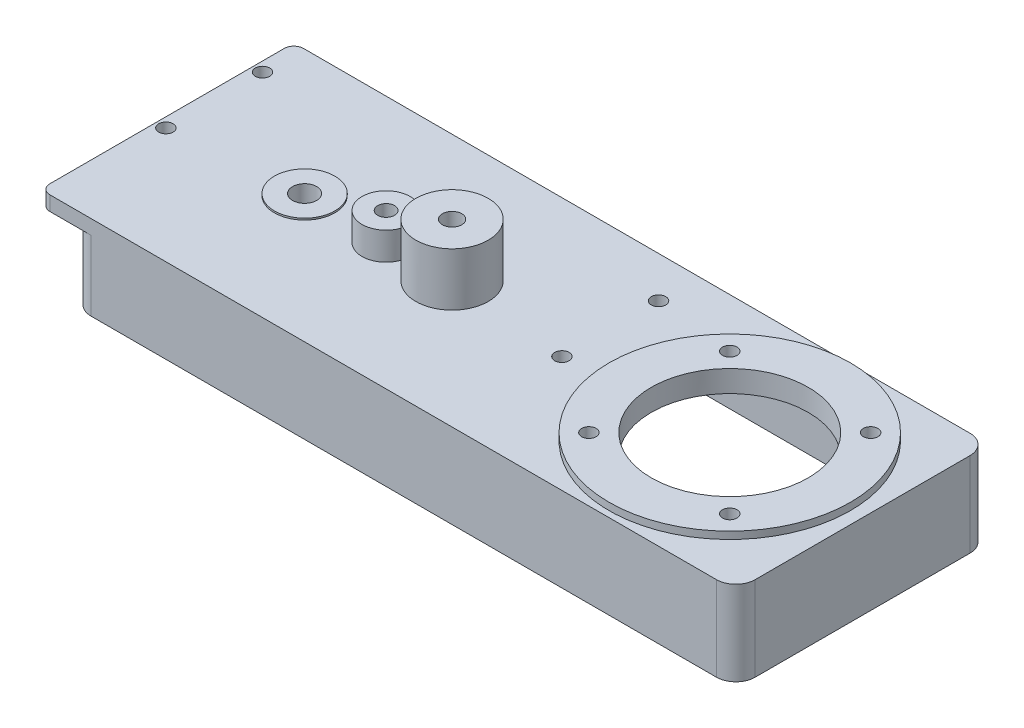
ISO-10303-21;
HEADER;
FILE_DESCRIPTION(('STEP AP214'),'2;1');
FILE_NAME('part.step','',(''),(''),'','','');
FILE_SCHEMA(('AUTOMOTIVE_DESIGN { 1 0 10303 214 1 1 1 1 }'));
ENDSEC;
DATA;
#1=APPLICATION_CONTEXT('core data for automotive mechanical design processes');
#2=APPLICATION_PROTOCOL_DEFINITION('international standard','automotive_design',2000,#1);
#3=PRODUCT_CONTEXT('',#1,'mechanical');
#4=PRODUCT('Part','Part','',(#3));
#5=PRODUCT_RELATED_PRODUCT_CATEGORY('part','',(#4));
#6=PRODUCT_DEFINITION_FORMATION('','',#4);
#7=PRODUCT_DEFINITION_CONTEXT('part definition',#1,'design');
#8=PRODUCT_DEFINITION('design','',#6,#7);
#9=PRODUCT_DEFINITION_SHAPE('','',#8);
#10=(LENGTH_UNIT() NAMED_UNIT(*) SI_UNIT(.MILLI.,.METRE.));
#11=(NAMED_UNIT(*) PLANE_ANGLE_UNIT() SI_UNIT($,.RADIAN.));
#12=(NAMED_UNIT(*) SI_UNIT($,.STERADIAN.) SOLID_ANGLE_UNIT());
#13=UNCERTAINTY_MEASURE_WITH_UNIT(LENGTH_MEASURE(1.E-05),#10,'distance_accuracy_value','');
#14=(GEOMETRIC_REPRESENTATION_CONTEXT(3) GLOBAL_UNCERTAINTY_ASSIGNED_CONTEXT((#13)) GLOBAL_UNIT_ASSIGNED_CONTEXT((#10,
#11,#12)) REPRESENTATION_CONTEXT('',''));
#15=CARTESIAN_POINT('',(0.,0.,0.));
#16=DIRECTION('',(0.,0.,1.));
#17=DIRECTION('',(1.,0.,0.));
#18=AXIS2_PLACEMENT_3D('',#15,#16,#17);
#19=CARTESIAN_POINT('',(0.,0.,105.));
#20=DIRECTION('',(1.,0.,0.));
#21=DIRECTION('',(0.,0.,-1.));
#22=AXIS2_PLACEMENT_3D('',#19,#20,#21);
#23=PLANE('',#22);
#24=CARTESIAN_POINT('',(0.,17.5,52.5));
#25=DIRECTION('',(1.,0.,0.));
#26=DIRECTION('',(0.,0.,-1.));
#27=AXIS2_PLACEMENT_3D('',#24,#25,#26);
#28=CIRCLE('',#27,5.);
#29=CARTESIAN_POINT('',(0.,17.5,47.5));
#30=VERTEX_POINT('',#29);
#31=EDGE_CURVE('E329',#30,#30,#28,.T.);
#32=ORIENTED_EDGE('',*,*,#31,.T.);
#33=EDGE_LOOP('',(#32));
#34=FACE_BOUND('',#33,.T.);
#35=DIRECTION('',(0.,0.,-1.));
#36=VECTOR('',#35,1.);
#37=CARTESIAN_POINT('',(0.,0.,105.));
#38=LINE('',#37,#36);
#39=CARTESIAN_POINT('',(0.,0.,97.));
#40=VERTEX_POINT('',#39);
#41=CARTESIAN_POINT('',(0.,0.,7.99999999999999));
#42=VERTEX_POINT('',#41);
#43=EDGE_CURVE('E233',#40,#42,#38,.T.);
#44=ORIENTED_EDGE('',*,*,#43,.F.);
#45=DIRECTION('',(0.,-1.,0.));
#46=VECTOR('',#45,1.);
#47=CARTESIAN_POINT('',(0.,0.,97.));
#48=LINE('',#47,#46);
#49=CARTESIAN_POINT('',(0.,29.,97.));
#50=VERTEX_POINT('',#49);
#51=EDGE_CURVE('E346',#40,#50,#48,.F.);
#52=ORIENTED_EDGE('',*,*,#51,.T.);
#53=DIRECTION('',(0.,0.,1.));
#54=VECTOR('',#53,1.);
#55=CARTESIAN_POINT('',(0.,29.,0.));
#56=LINE('',#55,#54);
#57=CARTESIAN_POINT('',(0.,29.,7.99999999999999));
#58=VERTEX_POINT('',#57);
#59=EDGE_CURVE('E332',#58,#50,#56,.T.);
#60=ORIENTED_EDGE('',*,*,#59,.F.);
#61=DIRECTION('',(0.,-1.,0.));
#62=VECTOR('',#61,1.);
#63=CARTESIAN_POINT('',(0.,0.,7.99999999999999));
#64=LINE('',#63,#62);
#65=EDGE_CURVE('E343',#58,#42,#64,.T.);
#66=ORIENTED_EDGE('',*,*,#65,.T.);
#67=EDGE_LOOP('',(#44,#52,#60,#66));
#68=FACE_BOUND('',#67,.T.);
#69=ADVANCED_FACE('F24',(#34,#68),#23,.F.);
#70=CARTESIAN_POINT('',(0.,35.,105.));
#71=DIRECTION('',(0.,-1.,0.));
#72=DIRECTION('',(0.,0.,-1.));
#73=AXIS2_PLACEMENT_3D('',#70,#71,#72);
#74=PLANE('',#73);
#75=CARTESIAN_POINT('',(155.,35.,17.));
#76=DIRECTION('',(0.,-1.,0.));
#77=DIRECTION('',(0.,0.,-1.));
#78=AXIS2_PLACEMENT_3D('',#75,#76,#77);
#79=CIRCLE('',#78,3.);
#80=CARTESIAN_POINT('',(155.,35.,14.));
#81=VERTEX_POINT('',#80);
#82=EDGE_CURVE('E840',#81,#81,#79,.T.);
#83=ORIENTED_EDGE('',*,*,#82,.T.);
#84=EDGE_LOOP('',(#83));
#85=FACE_BOUND('',#84,.T.);
#86=CARTESIAN_POINT('',(155.,35.,57.));
#87=DIRECTION('',(0.,-1.,0.));
#88=DIRECTION('',(0.,0.,-1.));
#89=AXIS2_PLACEMENT_3D('',#86,#87,#88);
#90=CIRCLE('',#89,3.);
#91=CARTESIAN_POINT('',(155.,35.,54.));
#92=VERTEX_POINT('',#91);
#93=EDGE_CURVE('E844',#92,#92,#90,.T.);
#94=ORIENTED_EDGE('',*,*,#93,.T.);
#95=EDGE_LOOP('',(#94));
#96=FACE_BOUND('',#95,.T.);
#97=CARTESIAN_POINT('',(-9.,35.,17.));
#98=DIRECTION('',(0.,-1.,0.));
#99=DIRECTION('',(0.,0.,-1.));
#100=AXIS2_PLACEMENT_3D('',#97,#98,#99);
#101=CIRCLE('',#100,3.);
#102=CARTESIAN_POINT('',(-9.,35.,14.));
#103=VERTEX_POINT('',#102);
#104=EDGE_CURVE('E853',#103,#103,#101,.T.);
#105=ORIENTED_EDGE('',*,*,#104,.T.);
#106=EDGE_LOOP('',(#105));
#107=FACE_BOUND('',#106,.T.);
#108=CARTESIAN_POINT('',(-9.,35.,57.));
#109=DIRECTION('',(0.,-1.,0.));
#110=DIRECTION('',(0.,0.,-1.));
#111=AXIS2_PLACEMENT_3D('',#108,#109,#110);
#112=CIRCLE('',#111,3.);
#113=CARTESIAN_POINT('',(-9.,35.,54.));
#114=VERTEX_POINT('',#113);
#115=EDGE_CURVE('E858',#114,#114,#112,.T.);
#116=ORIENTED_EDGE('',*,*,#115,.T.);
#117=EDGE_LOOP('',(#116));
#118=FACE_BOUND('',#117,.T.);
#119=CARTESIAN_POINT('',(77.7,35.,52.5));
#120=DIRECTION('',(0.,-1.,0.));
#121=DIRECTION('',(0.,0.,-1.));
#122=AXIS2_PLACEMENT_3D('',#119,#120,#121);
#123=CIRCLE('',#122,9.99999999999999);
#124=CARTESIAN_POINT('',(77.7,35.,42.5));
#125=VERTEX_POINT('',#124);
#126=EDGE_CURVE('E244',#125,#125,#123,.F.);
#127=ORIENTED_EDGE('',*,*,#126,.F.);
#128=EDGE_LOOP('',(#127));
#129=FACE_BOUND('',#128,.T.);
#130=CARTESIAN_POINT('',(220.,35.,52.5));
#131=DIRECTION('',(0.,-1.,0.));
#132=DIRECTION('',(0.,0.,-1.));
#133=AXIS2_PLACEMENT_3D('',#130,#131,#132);
#134=CIRCLE('',#133,50.);
#135=CARTESIAN_POINT('',(220.,35.,2.5));
#136=VERTEX_POINT('',#135);
#137=EDGE_CURVE('E236',#136,#136,#134,.F.);
#138=ORIENTED_EDGE('',*,*,#137,.F.);
#139=EDGE_LOOP('',(#138));
#140=FACE_BOUND('',#139,.T.);
#141=DIRECTION('',(0.,0.,-1.));
#142=VECTOR('',#141,1.);
#143=CARTESIAN_POINT('',(-13.,35.,0.));
#144=LINE('',#143,#142);
#145=CARTESIAN_POINT('',(-13.,35.,101.));
#146=VERTEX_POINT('',#145);
#147=CARTESIAN_POINT('',(-13.,35.,4.));
#148=VERTEX_POINT('',#147);
#149=EDGE_CURVE('E293',#146,#148,#144,.T.);
#150=ORIENTED_EDGE('',*,*,#149,.F.);
#151=CARTESIAN_POINT('',(-9.,35.,101.));
#152=DIRECTION('',(0.,-1.,0.));
#153=DIRECTION('',(0.,0.,-1.));
#154=AXIS2_PLACEMENT_3D('',#151,#152,#153);
#155=CIRCLE('',#154,4.);
#156=CARTESIAN_POINT('',(-9.,35.,105.));
#157=VERTEX_POINT('',#156);
#158=EDGE_CURVE('E294',#146,#157,#155,.F.);
#159=ORIENTED_EDGE('',*,*,#158,.T.);
#160=DIRECTION('',(-1.,0.,0.));
#161=VECTOR('',#160,1.);
#162=CARTESIAN_POINT('',(0.,35.,105.));
#163=LINE('',#162,#161);
#164=CARTESIAN_POINT('',(267.,35.,105.));
#165=VERTEX_POINT('',#164);
#166=EDGE_CURVE('E225',#165,#157,#163,.T.);
#167=ORIENTED_EDGE('',*,*,#166,.F.);
#168=CARTESIAN_POINT('',(267.,35.,97.));
#169=DIRECTION('',(0.,-1.,0.));
#170=DIRECTION('',(0.,0.,-1.));
#171=AXIS2_PLACEMENT_3D('',#168,#169,#170);
#172=CIRCLE('',#171,8.);
#173=CARTESIAN_POINT('',(275.,35.,97.));
#174=VERTEX_POINT('',#173);
#175=EDGE_CURVE('E355',#165,#174,#172,.F.);
#176=ORIENTED_EDGE('',*,*,#175,.T.);
#177=DIRECTION('',(0.,0.,-1.));
#178=VECTOR('',#177,1.);
#179=CARTESIAN_POINT('',(275.,35.,105.));
#180=LINE('',#179,#178);
#181=CARTESIAN_POINT('',(275.,35.,7.99999999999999));
#182=VERTEX_POINT('',#181);
#183=EDGE_CURVE('E227',#174,#182,#180,.T.);
#184=ORIENTED_EDGE('',*,*,#183,.T.);
#185=CARTESIAN_POINT('',(267.,35.,7.99999999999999));
#186=DIRECTION('',(0.,-1.,0.));
#187=DIRECTION('',(0.,0.,-1.));
#188=AXIS2_PLACEMENT_3D('',#185,#186,#187);
#189=CIRCLE('',#188,8.);
#190=CARTESIAN_POINT('',(267.,35.,0.));
#191=VERTEX_POINT('',#190);
#192=EDGE_CURVE('E353',#182,#191,#189,.F.);
#193=ORIENTED_EDGE('',*,*,#192,.T.);
#194=DIRECTION('',(-1.,0.,0.));
#195=VECTOR('',#194,1.);
#196=CARTESIAN_POINT('',(0.,35.,0.));
#197=LINE('',#196,#195);
#198=CARTESIAN_POINT('',(-9.,35.,0.));
#199=VERTEX_POINT('',#198);
#200=EDGE_CURVE('E219',#191,#199,#197,.T.);
#201=ORIENTED_EDGE('',*,*,#200,.T.);
#202=CARTESIAN_POINT('',(-9.,35.,4.));
#203=DIRECTION('',(0.,-1.,0.));
#204=DIRECTION('',(0.,0.,-1.));
#205=AXIS2_PLACEMENT_3D('',#202,#203,#204);
#206=CIRCLE('',#205,4.);
#207=EDGE_CURVE('E372',#199,#148,#206,.F.);
#208=ORIENTED_EDGE('',*,*,#207,.T.);
#209=EDGE_LOOP('',(#150,#159,#167,#176,#184,#193,#201,#208));
#210=FACE_BOUND('',#209,.T.);
#211=CARTESIAN_POINT('',(105.,35.,52.5));
#212=DIRECTION('',(0.,-1.,0.));
#213=DIRECTION('',(0.,0.,-1.));
#214=AXIS2_PLACEMENT_3D('',#211,#212,#213);
#215=CIRCLE('',#214,15.);
#216=CARTESIAN_POINT('',(105.,35.,37.5));
#217=VERTEX_POINT('',#216);
#218=EDGE_CURVE('E239',#217,#217,#215,.F.);
#219=ORIENTED_EDGE('',*,*,#218,.F.);
#220=EDGE_LOOP('',(#219));
#221=FACE_BOUND('',#220,.T.);
#222=CARTESIAN_POINT('',(43.95,35.,52.5));
#223=DIRECTION('',(0.,-1.,0.));
#224=DIRECTION('',(0.,0.,-1.));
#225=AXIS2_PLACEMENT_3D('',#222,#223,#224);
#226=CIRCLE('',#225,12.5);
#227=CARTESIAN_POINT('',(43.95,35.,40.));
#228=VERTEX_POINT('',#227);
#229=EDGE_CURVE('E252',#228,#228,#226,.F.);
#230=ORIENTED_EDGE('',*,*,#229,.F.);
#231=EDGE_LOOP('',(#230));
#232=FACE_BOUND('',#231,.T.);
#233=ADVANCED_FACE('F378',(#85,#96,#107,#118,#129,#140,#210,#221,#232),#74,.F.);
#234=CARTESIAN_POINT('',(6.,29.,99.));
#235=DIRECTION('',(0.,-1.,0.));
#236=DIRECTION('',(0.,0.,-1.));
#237=AXIS2_PLACEMENT_3D('',#234,#235,#236);
#238=PLANE('',#237);
#239=CARTESIAN_POINT('',(155.,29.,17.));
#240=DIRECTION('',(0.,-1.,0.));
#241=DIRECTION('',(0.,0.,-1.));
#242=AXIS2_PLACEMENT_3D('',#239,#240,#241);
#243=CIRCLE('',#242,3.);
#244=CARTESIAN_POINT('',(155.,29.,14.));
#245=VERTEX_POINT('',#244);
#246=EDGE_CURVE('E837',#245,#245,#243,.T.);
#247=ORIENTED_EDGE('',*,*,#246,.F.);
#248=EDGE_LOOP('',(#247));
#249=FACE_BOUND('',#248,.T.);
#250=CARTESIAN_POINT('',(155.,29.,57.));
#251=DIRECTION('',(0.,-1.,0.));
#252=DIRECTION('',(0.,0.,-1.));
#253=AXIS2_PLACEMENT_3D('',#250,#251,#252);
#254=CIRCLE('',#253,3.);
#255=CARTESIAN_POINT('',(155.,29.,54.));
#256=VERTEX_POINT('',#255);
#257=EDGE_CURVE('E841',#256,#256,#254,.T.);
#258=ORIENTED_EDGE('',*,*,#257,.F.);
#259=EDGE_LOOP('',(#258));
#260=FACE_BOUND('',#259,.T.);
#261=CARTESIAN_POINT('',(249.168154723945,29.,81.6681547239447));
#262=DIRECTION('',(0.,-1.,0.));
#263=DIRECTION('',(1.,0.,0.));
#264=AXIS2_PLACEMENT_3D('',#261,#262,#263);
#265=CIRCLE('',#264,2.99999999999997);
#266=CARTESIAN_POINT('',(252.168154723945,29.,81.6681547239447));
#267=VERTEX_POINT('',#266);
#268=EDGE_CURVE('E321',#267,#267,#265,.T.);
#269=ORIENTED_EDGE('',*,*,#268,.F.);
#270=EDGE_LOOP('',(#269));
#271=FACE_BOUND('',#270,.T.);
#272=CARTESIAN_POINT('',(190.831845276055,29.,81.6681547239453));
#273=DIRECTION('',(0.,-1.,0.));
#274=DIRECTION('',(0.,0.,1.));
#275=AXIS2_PLACEMENT_3D('',#272,#273,#274);
#276=CIRCLE('',#275,2.99999999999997);
#277=CARTESIAN_POINT('',(190.831845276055,29.,84.6681547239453));
#278=VERTEX_POINT('',#277);
#279=EDGE_CURVE('E311',#278,#278,#276,.T.);
#280=ORIENTED_EDGE('',*,*,#279,.F.);
#281=EDGE_LOOP('',(#280));
#282=FACE_BOUND('',#281,.T.);
#283=CARTESIAN_POINT('',(190.831845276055,29.,23.331845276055));
#284=DIRECTION('',(0.,-1.,0.));
#285=DIRECTION('',(-1.,0.,0.));
#286=AXIS2_PLACEMENT_3D('',#283,#284,#285);
#287=CIRCLE('',#286,2.99999999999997);
#288=CARTESIAN_POINT('',(187.831845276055,29.,23.331845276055));
#289=VERTEX_POINT('',#288);
#290=EDGE_CURVE('E308',#289,#289,#287,.T.);
#291=ORIENTED_EDGE('',*,*,#290,.F.);
#292=EDGE_LOOP('',(#291));
#293=FACE_BOUND('',#292,.T.);
#294=CARTESIAN_POINT('',(249.168154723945,29.,23.3318452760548));
#295=DIRECTION('',(0.,-1.,0.));
#296=DIRECTION('',(0.,0.,-1.));
#297=AXIS2_PLACEMENT_3D('',#294,#295,#296);
#298=CIRCLE('',#297,2.99999999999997);
#299=CARTESIAN_POINT('',(249.168154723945,29.,20.3318452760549));
#300=VERTEX_POINT('',#299);
#301=EDGE_CURVE('E305',#300,#300,#298,.T.);
#302=ORIENTED_EDGE('',*,*,#301,.F.);
#303=EDGE_LOOP('',(#302));
#304=FACE_BOUND('',#303,.T.);
#305=CARTESIAN_POINT('',(220.,29.,52.5));
#306=DIRECTION('',(0.,-1.,0.));
#307=DIRECTION('',(0.,0.,-1.));
#308=AXIS2_PLACEMENT_3D('',#305,#306,#307);
#309=CIRCLE('',#308,32.5);
#310=CARTESIAN_POINT('',(220.,29.,20.));
#311=VERTEX_POINT('',#310);
#312=EDGE_CURVE('E209',#311,#311,#309,.F.);
#313=ORIENTED_EDGE('',*,*,#312,.T.);
#314=EDGE_LOOP('',(#313));
#315=FACE_BOUND('',#314,.T.);
#316=DIRECTION('',(0.,0.,-1.));
#317=VECTOR('',#316,1.);
#318=CARTESIAN_POINT('',(6.,29.,99.));
#319=LINE('',#318,#317);
#320=CARTESIAN_POINT('',(6.,29.,97.));
#321=VERTEX_POINT('',#320);
#322=CARTESIAN_POINT('',(6.,29.,8.));
#323=VERTEX_POINT('',#322);
#324=EDGE_CURVE('E202',#321,#323,#319,.T.);
#325=ORIENTED_EDGE('',*,*,#324,.T.);
#326=CARTESIAN_POINT('',(8.,29.,8.));
#327=DIRECTION('',(0.,-1.,0.));
#328=DIRECTION('',(0.,0.,-1.));
#329=AXIS2_PLACEMENT_3D('',#326,#327,#328);
#330=CIRCLE('',#329,2.);
#331=CARTESIAN_POINT('',(8.,29.,6.));
#332=VERTEX_POINT('',#331);
#333=EDGE_CURVE('E268',#323,#332,#330,.T.);
#334=ORIENTED_EDGE('',*,*,#333,.T.);
#335=DIRECTION('',(1.,0.,0.));
#336=VECTOR('',#335,1.);
#337=CARTESIAN_POINT('',(6.,29.,6.));
#338=LINE('',#337,#336);
#339=CARTESIAN_POINT('',(267.,29.,6.));
#340=VERTEX_POINT('',#339);
#341=EDGE_CURVE('E182',#332,#340,#338,.T.);
#342=ORIENTED_EDGE('',*,*,#341,.T.);
#343=CARTESIAN_POINT('',(267.,29.,8.));
#344=DIRECTION('',(0.,-1.,0.));
#345=DIRECTION('',(0.,0.,-1.));
#346=AXIS2_PLACEMENT_3D('',#343,#344,#345);
#347=CIRCLE('',#346,2.);
#348=CARTESIAN_POINT('',(269.,29.,8.));
#349=VERTEX_POINT('',#348);
#350=EDGE_CURVE('E262',#340,#349,#347,.T.);
#351=ORIENTED_EDGE('',*,*,#350,.T.);
#352=DIRECTION('',(0.,0.,1.));
#353=VECTOR('',#352,1.);
#354=CARTESIAN_POINT('',(269.,29.,6.));
#355=LINE('',#354,#353);
#356=CARTESIAN_POINT('',(269.,29.,97.));
#357=VERTEX_POINT('',#356);
#358=EDGE_CURVE('E206',#349,#357,#355,.T.);
#359=ORIENTED_EDGE('',*,*,#358,.T.);
#360=CARTESIAN_POINT('',(267.,29.,97.));
#361=DIRECTION('',(0.,-1.,0.));
#362=DIRECTION('',(0.,0.,-1.));
#363=AXIS2_PLACEMENT_3D('',#360,#361,#362);
#364=CIRCLE('',#363,2.);
#365=CARTESIAN_POINT('',(267.,29.,99.));
#366=VERTEX_POINT('',#365);
#367=EDGE_CURVE('E264',#357,#366,#364,.T.);
#368=ORIENTED_EDGE('',*,*,#367,.T.);
#369=DIRECTION('',(-1.,0.,0.));
#370=VECTOR('',#369,1.);
#371=CARTESIAN_POINT('',(269.,29.,99.));
#372=LINE('',#371,#370);
#373=CARTESIAN_POINT('',(8.,29.,99.));
#374=VERTEX_POINT('',#373);
#375=EDGE_CURVE('E194',#366,#374,#372,.T.);
#376=ORIENTED_EDGE('',*,*,#375,.T.);
#377=CARTESIAN_POINT('',(8.,29.,97.));
#378=DIRECTION('',(0.,-1.,0.));
#379=DIRECTION('',(0.,0.,-1.));
#380=AXIS2_PLACEMENT_3D('',#377,#378,#379);
#381=CIRCLE('',#380,2.);
#382=EDGE_CURVE('E266',#374,#321,#381,.T.);
#383=ORIENTED_EDGE('',*,*,#382,.T.);
#384=EDGE_LOOP('',(#325,#334,#342,#351,#359,#368,#376,#383));
#385=FACE_BOUND('',#384,.T.);
#386=CARTESIAN_POINT('',(105.,29.,52.5));
#387=DIRECTION('',(0.,-1.,0.));
#388=DIRECTION('',(0.,0.,-1.));
#389=AXIS2_PLACEMENT_3D('',#386,#387,#388);
#390=CIRCLE('',#389,9.99999999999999);
#391=CARTESIAN_POINT('',(105.,29.,42.5));
#392=VERTEX_POINT('',#391);
#393=EDGE_CURVE('E413',#392,#392,#390,.T.);
#394=ORIENTED_EDGE('',*,*,#393,.F.);
#395=EDGE_LOOP('',(#394));
#396=FACE_BOUND('',#395,.T.);
#397=CARTESIAN_POINT('',(77.7,29.,52.5));
#398=DIRECTION('',(0.,-1.,0.));
#399=DIRECTION('',(0.,0.,-1.));
#400=AXIS2_PLACEMENT_3D('',#397,#398,#399);
#401=CIRCLE('',#400,3.50000000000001);
#402=CARTESIAN_POINT('',(77.7,29.,56.));
#403=VERTEX_POINT('',#402);
#404=EDGE_CURVE('E407',#403,#403,#401,.T.);
#405=ORIENTED_EDGE('',*,*,#404,.F.);
#406=EDGE_LOOP('',(#405));
#407=FACE_BOUND('',#406,.T.);
#408=CARTESIAN_POINT('',(43.95,29.,52.5));
#409=DIRECTION('',(0.,-1.,0.));
#410=DIRECTION('',(0.,0.,-1.));
#411=AXIS2_PLACEMENT_3D('',#408,#409,#410);
#412=CIRCLE('',#411,12.5);
#413=CARTESIAN_POINT('',(43.95,29.,40.));
#414=VERTEX_POINT('',#413);
#415=EDGE_CURVE('E253',#414,#414,#412,.F.);
#416=ORIENTED_EDGE('',*,*,#415,.T.);
#417=EDGE_LOOP('',(#416));
#418=FACE_BOUND('',#417,.T.);
#419=ADVANCED_FACE('F435',(#249,#260,#271,#282,#293,#304,#315,#385,#396,#407,#418),#238,.T.);
#420=CARTESIAN_POINT('',(105.,0.,52.5));
#421=DIRECTION('',(0.,1.,0.));
#422=DIRECTION('',(0.,0.,1.));
#423=AXIS2_PLACEMENT_3D('',#420,#421,#422);
#424=CYLINDRICAL_SURFACE('',#423,4.00000000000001);
#425=CARTESIAN_POINT('',(105.,57.,52.5));
#426=DIRECTION('',(0.,1.,0.));
#427=DIRECTION('',(0.,0.,1.));
#428=AXIS2_PLACEMENT_3D('',#425,#426,#427);
#429=CIRCLE('',#428,4.00000000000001);
#430=CARTESIAN_POINT('',(105.,57.,56.5));
#431=VERTEX_POINT('',#430);
#432=EDGE_CURVE('E248',#431,#431,#429,.T.);
#433=ORIENTED_EDGE('',*,*,#432,.T.);
#434=EDGE_LOOP('',(#433));
#435=FACE_BOUND('',#434,.T.);
#436=CARTESIAN_POINT('',(105.,40.25,52.5));
#437=DIRECTION('',(0.,-1.,0.));
#438=DIRECTION('',(0.,0.,-1.));
#439=AXIS2_PLACEMENT_3D('',#436,#437,#438);
#440=CIRCLE('',#439,4.00000000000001);
#441=CARTESIAN_POINT('',(105.,40.25,48.5));
#442=VERTEX_POINT('',#441);
#443=EDGE_CURVE('E245',#442,#442,#440,.F.);
#444=ORIENTED_EDGE('',*,*,#443,.F.);
#445=EDGE_LOOP('',(#444));
#446=FACE_BOUND('',#445,.T.);
#447=ADVANCED_FACE('F579',(#435,#446),#424,.F.);
#448=CARTESIAN_POINT('',(220.,0.,52.5));
#449=DIRECTION('',(0.,1.,0.));
#450=DIRECTION('',(0.,0.,1.));
#451=AXIS2_PLACEMENT_3D('',#448,#449,#450);
#452=CYLINDRICAL_SURFACE('',#451,32.5);
#453=CARTESIAN_POINT('',(220.,38.,52.5));
#454=DIRECTION('',(0.,1.,0.));
#455=DIRECTION('',(0.,0.,1.));
#456=AXIS2_PLACEMENT_3D('',#453,#454,#455);
#457=CIRCLE('',#456,32.5);
#458=CARTESIAN_POINT('',(220.,38.,85.));
#459=VERTEX_POINT('',#458);
#460=EDGE_CURVE('E210',#459,#459,#457,.T.);
#461=ORIENTED_EDGE('',*,*,#460,.T.);
#462=EDGE_LOOP('',(#461));
#463=FACE_BOUND('',#462,.T.);
#464=ORIENTED_EDGE('',*,*,#312,.F.);
#465=EDGE_LOOP('',(#464));
#466=FACE_BOUND('',#465,.T.);
#467=ADVANCED_FACE('F582',(#463,#466),#452,.F.);
#468=CARTESIAN_POINT('',(0.,0.,105.));
#469=DIRECTION('',(0.,1.,0.));
#470=DIRECTION('',(0.,0.,1.));
#471=AXIS2_PLACEMENT_3D('',#468,#469,#470);
#472=PLANE('',#471);
#473=DIRECTION('',(0.,0.,-1.));
#474=VECTOR('',#473,1.);
#475=CARTESIAN_POINT('',(6.,0.,99.));
#476=LINE('',#475,#474);
#477=CARTESIAN_POINT('',(6.,0.,97.));
#478=VERTEX_POINT('',#477);
#479=CARTESIAN_POINT('',(6.,0.,8.));
#480=VERTEX_POINT('',#479);
#481=EDGE_CURVE('E191',#478,#480,#476,.T.);
#482=ORIENTED_EDGE('',*,*,#481,.F.);
#483=CARTESIAN_POINT('',(8.,0.,97.));
#484=DIRECTION('',(0.,1.,0.));
#485=DIRECTION('',(0.,0.,1.));
#486=AXIS2_PLACEMENT_3D('',#483,#484,#485);
#487=CIRCLE('',#486,2.);
#488=CARTESIAN_POINT('',(8.,0.,99.));
#489=VERTEX_POINT('',#488);
#490=EDGE_CURVE('E172',#478,#489,#487,.T.);
#491=ORIENTED_EDGE('',*,*,#490,.T.);
#492=DIRECTION('',(-1.,0.,0.));
#493=VECTOR('',#492,1.);
#494=CARTESIAN_POINT('',(269.,0.,99.));
#495=LINE('',#494,#493);
#496=CARTESIAN_POINT('',(267.,0.,99.));
#497=VERTEX_POINT('',#496);
#498=EDGE_CURVE('E196',#497,#489,#495,.T.);
#499=ORIENTED_EDGE('',*,*,#498,.F.);
#500=CARTESIAN_POINT('',(267.,0.,97.));
#501=DIRECTION('',(0.,1.,0.));
#502=DIRECTION('',(0.,0.,1.));
#503=AXIS2_PLACEMENT_3D('',#500,#501,#502);
#504=CIRCLE('',#503,2.);
#505=CARTESIAN_POINT('',(269.,0.,97.));
#506=VERTEX_POINT('',#505);
#507=EDGE_CURVE('E280',#497,#506,#504,.T.);
#508=ORIENTED_EDGE('',*,*,#507,.T.);
#509=DIRECTION('',(0.,0.,1.));
#510=VECTOR('',#509,1.);
#511=CARTESIAN_POINT('',(269.,0.,6.));
#512=LINE('',#511,#510);
#513=CARTESIAN_POINT('',(269.,0.,8.));
#514=VERTEX_POINT('',#513);
#515=EDGE_CURVE('E190',#514,#506,#512,.T.);
#516=ORIENTED_EDGE('',*,*,#515,.F.);
#517=CARTESIAN_POINT('',(267.,0.,8.));
#518=DIRECTION('',(0.,1.,0.));
#519=DIRECTION('',(0.,0.,1.));
#520=AXIS2_PLACEMENT_3D('',#517,#518,#519);
#521=CIRCLE('',#520,2.);
#522=CARTESIAN_POINT('',(267.,0.,6.));
#523=VERTEX_POINT('',#522);
#524=EDGE_CURVE('E189',#514,#523,#521,.T.);
#525=ORIENTED_EDGE('',*,*,#524,.T.);
#526=DIRECTION('',(1.,0.,0.));
#527=VECTOR('',#526,1.);
#528=CARTESIAN_POINT('',(6.,0.,6.));
#529=LINE('',#528,#527);
#530=CARTESIAN_POINT('',(8.,0.,6.));
#531=VERTEX_POINT('',#530);
#532=EDGE_CURVE('E179',#531,#523,#529,.T.);
#533=ORIENTED_EDGE('',*,*,#532,.F.);
#534=CARTESIAN_POINT('',(8.,0.,8.));
#535=DIRECTION('',(0.,1.,0.));
#536=DIRECTION('',(0.,0.,1.));
#537=AXIS2_PLACEMENT_3D('',#534,#535,#536);
#538=CIRCLE('',#537,2.);
#539=EDGE_CURVE('E162',#531,#480,#538,.T.);
#540=ORIENTED_EDGE('',*,*,#539,.T.);
#541=EDGE_LOOP('',(#482,#491,#499,#508,#516,#525,#533,#540));
#542=FACE_BOUND('',#541,.T.);
#543=DIRECTION('',(1.,0.,0.));
#544=VECTOR('',#543,1.);
#545=CARTESIAN_POINT('',(0.,0.,105.));
#546=LINE('',#545,#544);
#547=CARTESIAN_POINT('',(8.,0.,105.));
#548=VERTEX_POINT('',#547);
#549=CARTESIAN_POINT('',(267.,0.,105.));
#550=VERTEX_POINT('',#549);
#551=EDGE_CURVE('E222',#548,#550,#546,.T.);
#552=ORIENTED_EDGE('',*,*,#551,.F.);
#553=CARTESIAN_POINT('',(8.,0.,97.));
#554=DIRECTION('',(0.,1.,0.));
#555=DIRECTION('',(0.,0.,1.));
#556=AXIS2_PLACEMENT_3D('',#553,#554,#555);
#557=CIRCLE('',#556,8.);
#558=EDGE_CURVE('E341',#548,#40,#557,.F.);
#559=ORIENTED_EDGE('',*,*,#558,.T.);
#560=ORIENTED_EDGE('',*,*,#43,.T.);
#561=CARTESIAN_POINT('',(8.,0.,7.99999999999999));
#562=DIRECTION('',(0.,1.,0.));
#563=DIRECTION('',(0.,0.,1.));
#564=AXIS2_PLACEMENT_3D('',#561,#562,#563);
#565=CIRCLE('',#564,8.);
#566=CARTESIAN_POINT('',(8.,0.,0.));
#567=VERTEX_POINT('',#566);
#568=EDGE_CURVE('E477',#42,#567,#565,.F.);
#569=ORIENTED_EDGE('',*,*,#568,.T.);
#570=DIRECTION('',(1.,0.,0.));
#571=VECTOR('',#570,1.);
#572=CARTESIAN_POINT('',(0.,0.,0.));
#573=LINE('',#572,#571);
#574=CARTESIAN_POINT('',(267.,0.,0.));
#575=VERTEX_POINT('',#574);
#576=EDGE_CURVE('E216',#567,#575,#573,.T.);
#577=ORIENTED_EDGE('',*,*,#576,.T.);
#578=CARTESIAN_POINT('',(267.,0.,7.99999999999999));
#579=DIRECTION('',(0.,1.,0.));
#580=DIRECTION('',(0.,0.,1.));
#581=AXIS2_PLACEMENT_3D('',#578,#579,#580);
#582=CIRCLE('',#581,8.);
#583=CARTESIAN_POINT('',(275.,0.,7.99999999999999));
#584=VERTEX_POINT('',#583);
#585=EDGE_CURVE('E480',#575,#584,#582,.F.);
#586=ORIENTED_EDGE('',*,*,#585,.T.);
#587=DIRECTION('',(0.,0.,-1.));
#588=VECTOR('',#587,1.);
#589=CARTESIAN_POINT('',(275.,0.,105.));
#590=LINE('',#589,#588);
#591=CARTESIAN_POINT('',(275.,0.,97.));
#592=VERTEX_POINT('',#591);
#593=EDGE_CURVE('E230',#592,#584,#590,.T.);
#594=ORIENTED_EDGE('',*,*,#593,.F.);
#595=CARTESIAN_POINT('',(267.,0.,97.));
#596=DIRECTION('',(0.,1.,0.));
#597=DIRECTION('',(0.,0.,1.));
#598=AXIS2_PLACEMENT_3D('',#595,#596,#597);
#599=CIRCLE('',#598,8.);
#600=EDGE_CURVE('E479',#592,#550,#599,.F.);
#601=ORIENTED_EDGE('',*,*,#600,.T.);
#602=EDGE_LOOP('',(#552,#559,#560,#569,#577,#586,#594,#601));
#603=FACE_BOUND('',#602,.T.);
#604=ADVANCED_FACE('F186',(#542,#603),#472,.F.);
#605=CARTESIAN_POINT('',(275.,0.,105.));
#606=DIRECTION('',(-1.,0.,0.));
#607=DIRECTION('',(0.,0.,1.));
#608=AXIS2_PLACEMENT_3D('',#605,#606,#607);
#609=PLANE('',#608);
#610=ORIENTED_EDGE('',*,*,#183,.F.);
#611=DIRECTION('',(0.,1.,0.));
#612=VECTOR('',#611,1.);
#613=CARTESIAN_POINT('',(275.,0.,97.));
#614=LINE('',#613,#612);
#615=EDGE_CURVE('E360',#174,#592,#614,.F.);
#616=ORIENTED_EDGE('',*,*,#615,.T.);
#617=ORIENTED_EDGE('',*,*,#593,.T.);
#618=DIRECTION('',(0.,1.,0.));
#619=VECTOR('',#618,1.);
#620=CARTESIAN_POINT('',(275.,35.,7.99999999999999));
#621=LINE('',#620,#619);
#622=EDGE_CURVE('E357',#584,#182,#621,.T.);
#623=ORIENTED_EDGE('',*,*,#622,.T.);
#624=EDGE_LOOP('',(#610,#616,#617,#623));
#625=FACE_BOUND('',#624,.T.);
#626=ADVANCED_FACE('F492',(#625),#609,.F.);
#627=CARTESIAN_POINT('',(0.,35.,105.));
#628=DIRECTION('',(0.,0.,-1.));
#629=DIRECTION('',(-1.,0.,0.));
#630=AXIS2_PLACEMENT_3D('',#627,#628,#629);
#631=PLANE('',#630);
#632=ORIENTED_EDGE('',*,*,#166,.T.);
#633=DIRECTION('',(0.,1.,0.));
#634=VECTOR('',#633,1.);
#635=CARTESIAN_POINT('',(-9.,29.,105.));
#636=LINE('',#635,#634);
#637=CARTESIAN_POINT('',(-9.,29.,105.));
#638=VERTEX_POINT('',#637);
#639=EDGE_CURVE('E48',#157,#638,#636,.F.);
#640=ORIENTED_EDGE('',*,*,#639,.T.);
#641=DIRECTION('',(1.,0.,0.));
#642=VECTOR('',#641,1.);
#643=CARTESIAN_POINT('',(-13.,29.,105.));
#644=LINE('',#643,#642);
#645=CARTESIAN_POINT('',(8.,29.,105.));
#646=VERTEX_POINT('',#645);
#647=EDGE_CURVE('E289',#638,#646,#644,.T.);
#648=ORIENTED_EDGE('',*,*,#647,.T.);
#649=DIRECTION('',(0.,-1.,0.));
#650=VECTOR('',#649,1.);
#651=CARTESIAN_POINT('',(8.,35.,105.));
#652=LINE('',#651,#650);
#653=EDGE_CURVE('E472',#646,#548,#652,.T.);
#654=ORIENTED_EDGE('',*,*,#653,.T.);
#655=ORIENTED_EDGE('',*,*,#551,.T.);
#656=DIRECTION('',(0.,1.,0.));
#657=VECTOR('',#656,1.);
#658=CARTESIAN_POINT('',(267.,35.,105.));
#659=LINE('',#658,#657);
#660=EDGE_CURVE('E283',#550,#165,#659,.T.);
#661=ORIENTED_EDGE('',*,*,#660,.T.);
#662=EDGE_LOOP('',(#632,#640,#648,#654,#655,#661));
#663=FACE_BOUND('',#662,.T.);
#664=ADVANCED_FACE('F383',(#663),#631,.F.);
#665=CARTESIAN_POINT('',(0.,35.,0.));
#666=DIRECTION('',(0.,0.,-1.));
#667=DIRECTION('',(-1.,0.,0.));
#668=AXIS2_PLACEMENT_3D('',#665,#666,#667);
#669=PLANE('',#668);
#670=DIRECTION('',(1.,0.,0.));
#671=VECTOR('',#670,1.);
#672=CARTESIAN_POINT('',(-13.,29.,0.));
#673=LINE('',#672,#671);
#674=CARTESIAN_POINT('',(-9.,29.,0.));
#675=VERTEX_POINT('',#674);
#676=CARTESIAN_POINT('',(8.,29.,0.));
#677=VERTEX_POINT('',#676);
#678=EDGE_CURVE('E292',#675,#677,#673,.T.);
#679=ORIENTED_EDGE('',*,*,#678,.F.);
#680=DIRECTION('',(0.,-1.,0.));
#681=VECTOR('',#680,1.);
#682=CARTESIAN_POINT('',(-9.,35.,0.));
#683=LINE('',#682,#681);
#684=EDGE_CURVE('E11',#675,#199,#683,.F.);
#685=ORIENTED_EDGE('',*,*,#684,.T.);
#686=ORIENTED_EDGE('',*,*,#200,.F.);
#687=DIRECTION('',(0.,1.,0.));
#688=VECTOR('',#687,1.);
#689=CARTESIAN_POINT('',(267.,0.,0.));
#690=LINE('',#689,#688);
#691=EDGE_CURVE('E348',#191,#575,#690,.F.);
#692=ORIENTED_EDGE('',*,*,#691,.T.);
#693=ORIENTED_EDGE('',*,*,#576,.F.);
#694=DIRECTION('',(0.,-1.,0.));
#695=VECTOR('',#694,1.);
#696=CARTESIAN_POINT('',(8.,29.,0.));
#697=LINE('',#696,#695);
#698=EDGE_CURVE('E350',#567,#677,#697,.F.);
#699=ORIENTED_EDGE('',*,*,#698,.T.);
#700=EDGE_LOOP('',(#679,#685,#686,#692,#693,#699));
#701=FACE_BOUND('',#700,.T.);
#702=ADVANCED_FACE('F500',(#701),#669,.T.);
#703=CARTESIAN_POINT('',(220.,38.,52.5));
#704=DIRECTION('',(0.,-1.,0.));
#705=DIRECTION('',(0.,0.,-1.));
#706=AXIS2_PLACEMENT_3D('',#703,#704,#705);
#707=CYLINDRICAL_SURFACE('',#706,50.);
#708=CARTESIAN_POINT('',(220.,38.,52.5));
#709=DIRECTION('',(0.,1.,0.));
#710=DIRECTION('',(0.,0.,1.));
#711=AXIS2_PLACEMENT_3D('',#708,#709,#710);
#712=CIRCLE('',#711,50.);
#713=CARTESIAN_POINT('',(220.,38.,102.5));
#714=VERTEX_POINT('',#713);
#715=EDGE_CURVE('E213',#714,#714,#712,.T.);
#716=ORIENTED_EDGE('',*,*,#715,.F.);
#717=EDGE_LOOP('',(#716));
#718=FACE_BOUND('',#717,.T.);
#719=ORIENTED_EDGE('',*,*,#137,.T.);
#720=EDGE_LOOP('',(#719));
#721=FACE_BOUND('',#720,.T.);
#722=ADVANCED_FACE('F604',(#718,#721),#707,.T.);
#723=CARTESIAN_POINT('',(220.,38.,52.5));
#724=DIRECTION('',(0.,1.,0.));
#725=DIRECTION('',(0.,0.,1.));
#726=AXIS2_PLACEMENT_3D('',#723,#724,#725);
#727=PLANE('',#726);
#728=CARTESIAN_POINT('',(249.168154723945,38.,81.6681547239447));
#729=DIRECTION('',(0.,1.,0.));
#730=DIRECTION('',(0.,0.,1.));
#731=AXIS2_PLACEMENT_3D('',#728,#729,#730);
#732=CIRCLE('',#731,2.99999999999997);
#733=CARTESIAN_POINT('',(249.168154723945,38.,84.6681547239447));
#734=VERTEX_POINT('',#733);
#735=EDGE_CURVE('E27',#734,#734,#732,.T.);
#736=ORIENTED_EDGE('',*,*,#735,.F.);
#737=EDGE_LOOP('',(#736));
#738=FACE_BOUND('',#737,.T.);
#739=CARTESIAN_POINT('',(190.831845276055,38.,81.6681547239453));
#740=DIRECTION('',(0.,1.,0.));
#741=DIRECTION('',(0.,0.,1.));
#742=AXIS2_PLACEMENT_3D('',#739,#740,#741);
#743=CIRCLE('',#742,2.99999999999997);
#744=CARTESIAN_POINT('',(190.831845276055,38.,84.6681547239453));
#745=VERTEX_POINT('',#744);
#746=EDGE_CURVE('E309',#745,#745,#743,.T.);
#747=ORIENTED_EDGE('',*,*,#746,.F.);
#748=EDGE_LOOP('',(#747));
#749=FACE_BOUND('',#748,.T.);
#750=CARTESIAN_POINT('',(190.831845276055,38.,23.331845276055));
#751=DIRECTION('',(0.,1.,0.));
#752=DIRECTION('',(0.,0.,1.));
#753=AXIS2_PLACEMENT_3D('',#750,#751,#752);
#754=CIRCLE('',#753,2.99999999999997);
#755=CARTESIAN_POINT('',(190.831845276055,38.,26.331845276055));
#756=VERTEX_POINT('',#755);
#757=EDGE_CURVE('E306',#756,#756,#754,.T.);
#758=ORIENTED_EDGE('',*,*,#757,.F.);
#759=EDGE_LOOP('',(#758));
#760=FACE_BOUND('',#759,.T.);
#761=CARTESIAN_POINT('',(249.168154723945,38.,23.3318452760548));
#762=DIRECTION('',(0.,1.,0.));
#763=DIRECTION('',(0.,0.,1.));
#764=AXIS2_PLACEMENT_3D('',#761,#762,#763);
#765=CIRCLE('',#764,2.99999999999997);
#766=CARTESIAN_POINT('',(249.168154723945,38.,26.3318452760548));
#767=VERTEX_POINT('',#766);
#768=EDGE_CURVE('E301',#767,#767,#765,.T.);
#769=ORIENTED_EDGE('',*,*,#768,.F.);
#770=EDGE_LOOP('',(#769));
#771=FACE_BOUND('',#770,.T.);
#772=ORIENTED_EDGE('',*,*,#460,.F.);
#773=EDGE_LOOP('',(#772));
#774=FACE_BOUND('',#773,.T.);
#775=ORIENTED_EDGE('',*,*,#715,.T.);
#776=EDGE_LOOP('',(#775));
#777=FACE_BOUND('',#776,.T.);
#778=ADVANCED_FACE('F595',(#738,#749,#760,#771,#774,#777),#727,.T.);
#779=CARTESIAN_POINT('',(269.,29.,99.));
#780=DIRECTION('',(0.,0.,1.));
#781=DIRECTION('',(1.,0.,0.));
#782=AXIS2_PLACEMENT_3D('',#779,#780,#781);
#783=PLANE('',#782);
#784=ORIENTED_EDGE('',*,*,#498,.T.);
#785=DIRECTION('',(0.,-1.,0.));
#786=VECTOR('',#785,1.);
#787=CARTESIAN_POINT('',(8.,29.,99.));
#788=LINE('',#787,#786);
#789=EDGE_CURVE('E273',#489,#374,#788,.F.);
#790=ORIENTED_EDGE('',*,*,#789,.T.);
#791=ORIENTED_EDGE('',*,*,#375,.F.);
#792=DIRECTION('',(0.,-1.,0.));
#793=VECTOR('',#792,1.);
#794=CARTESIAN_POINT('',(267.,0.,99.));
#795=LINE('',#794,#793);
#796=EDGE_CURVE('E270',#366,#497,#795,.T.);
#797=ORIENTED_EDGE('',*,*,#796,.T.);
#798=EDGE_LOOP('',(#784,#790,#791,#797));
#799=FACE_BOUND('',#798,.T.);
#800=ADVANCED_FACE('F426',(#799),#783,.F.);
#801=CARTESIAN_POINT('',(269.,29.,6.));
#802=DIRECTION('',(1.,0.,0.));
#803=DIRECTION('',(0.,0.,-1.));
#804=AXIS2_PLACEMENT_3D('',#801,#802,#803);
#805=PLANE('',#804);
#806=ORIENTED_EDGE('',*,*,#515,.T.);
#807=DIRECTION('',(0.,-1.,0.));
#808=VECTOR('',#807,1.);
#809=CARTESIAN_POINT('',(269.,29.,97.));
#810=LINE('',#809,#808);
#811=EDGE_CURVE('E173',#506,#357,#810,.F.);
#812=ORIENTED_EDGE('',*,*,#811,.T.);
#813=ORIENTED_EDGE('',*,*,#358,.F.);
#814=DIRECTION('',(0.,-1.,0.));
#815=VECTOR('',#814,1.);
#816=CARTESIAN_POINT('',(269.,0.,8.));
#817=LINE('',#816,#815);
#818=EDGE_CURVE('E275',#349,#514,#817,.T.);
#819=ORIENTED_EDGE('',*,*,#818,.T.);
#820=EDGE_LOOP('',(#806,#812,#813,#819));
#821=FACE_BOUND('',#820,.T.);
#822=ADVANCED_FACE('F450',(#821),#805,.F.);
#823=CARTESIAN_POINT('',(6.,29.,6.));
#824=DIRECTION('',(0.,0.,-1.));
#825=DIRECTION('',(-1.,0.,0.));
#826=AXIS2_PLACEMENT_3D('',#823,#824,#825);
#827=PLANE('',#826);
#828=ORIENTED_EDGE('',*,*,#341,.F.);
#829=DIRECTION('',(0.,-1.,0.));
#830=VECTOR('',#829,1.);
#831=CARTESIAN_POINT('',(8.,0.,6.));
#832=LINE('',#831,#830);
#833=EDGE_CURVE('E166',#332,#531,#832,.T.);
#834=ORIENTED_EDGE('',*,*,#833,.T.);
#835=ORIENTED_EDGE('',*,*,#532,.T.);
#836=DIRECTION('',(0.,-1.,0.));
#837=VECTOR('',#836,1.);
#838=CARTESIAN_POINT('',(267.,29.,6.));
#839=LINE('',#838,#837);
#840=EDGE_CURVE('E184',#523,#340,#839,.F.);
#841=ORIENTED_EDGE('',*,*,#840,.T.);
#842=EDGE_LOOP('',(#828,#834,#835,#841));
#843=FACE_BOUND('',#842,.T.);
#844=ADVANCED_FACE('F178',(#843),#827,.F.);
#845=CARTESIAN_POINT('',(6.,29.,99.));
#846=DIRECTION('',(-1.,0.,0.));
#847=DIRECTION('',(0.,0.,1.));
#848=AXIS2_PLACEMENT_3D('',#845,#846,#847);
#849=PLANE('',#848);
#850=CARTESIAN_POINT('',(6.,17.5,52.5));
#851=DIRECTION('',(1.,0.,0.));
#852=DIRECTION('',(0.,0.,-1.));
#853=AXIS2_PLACEMENT_3D('',#850,#851,#852);
#854=CIRCLE('',#853,5.);
#855=CARTESIAN_POINT('',(6.,17.5,47.5));
#856=VERTEX_POINT('',#855);
#857=EDGE_CURVE('E304',#856,#856,#854,.T.);
#858=ORIENTED_EDGE('',*,*,#857,.F.);
#859=EDGE_LOOP('',(#858));
#860=FACE_BOUND('',#859,.T.);
#861=ORIENTED_EDGE('',*,*,#481,.T.);
#862=DIRECTION('',(0.,-1.,0.));
#863=VECTOR('',#862,1.);
#864=CARTESIAN_POINT('',(6.,29.,8.));
#865=LINE('',#864,#863);
#866=EDGE_CURVE('E167',#480,#323,#865,.F.);
#867=ORIENTED_EDGE('',*,*,#866,.T.);
#868=ORIENTED_EDGE('',*,*,#324,.F.);
#869=DIRECTION('',(0.,-1.,0.));
#870=VECTOR('',#869,1.);
#871=CARTESIAN_POINT('',(6.,0.,97.));
#872=LINE('',#871,#870);
#873=EDGE_CURVE('E183',#321,#478,#872,.T.);
#874=ORIENTED_EDGE('',*,*,#873,.T.);
#875=EDGE_LOOP('',(#861,#867,#868,#874));
#876=FACE_BOUND('',#875,.T.);
#877=ADVANCED_FACE('F438',(#860,#876),#849,.F.);
#878=CARTESIAN_POINT('',(105.,57.,52.5));
#879=DIRECTION('',(0.,-1.,0.));
#880=DIRECTION('',(0.,0.,-1.));
#881=AXIS2_PLACEMENT_3D('',#878,#879,#880);
#882=CYLINDRICAL_SURFACE('',#881,15.);
#883=CARTESIAN_POINT('',(105.,57.,52.5));
#884=DIRECTION('',(0.,1.,0.));
#885=DIRECTION('',(0.,0.,1.));
#886=AXIS2_PLACEMENT_3D('',#883,#884,#885);
#887=CIRCLE('',#886,15.);
#888=CARTESIAN_POINT('',(105.,57.,67.5));
#889=VERTEX_POINT('',#888);
#890=EDGE_CURVE('E420',#889,#889,#887,.T.);
#891=ORIENTED_EDGE('',*,*,#890,.F.);
#892=EDGE_LOOP('',(#891));
#893=FACE_BOUND('',#892,.T.);
#894=ORIENTED_EDGE('',*,*,#218,.T.);
#895=EDGE_LOOP('',(#894));
#896=FACE_BOUND('',#895,.T.);
#897=ADVANCED_FACE('F440',(#893,#896),#882,.T.);
#898=CARTESIAN_POINT('',(105.,57.,52.5));
#899=DIRECTION('',(0.,1.,0.));
#900=DIRECTION('',(0.,0.,1.));
#901=AXIS2_PLACEMENT_3D('',#898,#899,#900);
#902=PLANE('',#901);
#903=ORIENTED_EDGE('',*,*,#432,.F.);
#904=EDGE_LOOP('',(#903));
#905=FACE_BOUND('',#904,.T.);
#906=ORIENTED_EDGE('',*,*,#890,.T.);
#907=EDGE_LOOP('',(#906));
#908=FACE_BOUND('',#907,.T.);
#909=ADVANCED_FACE('F447',(#905,#908),#902,.T.);
#910=CARTESIAN_POINT('',(105.,40.25,52.5));
#911=DIRECTION('',(0.,-1.,0.));
#912=DIRECTION('',(0.,0.,-1.));
#913=AXIS2_PLACEMENT_3D('',#910,#911,#912);
#914=PLANE('',#913);
#915=CARTESIAN_POINT('',(105.,40.25,52.5));
#916=DIRECTION('',(0.,-1.,0.));
#917=DIRECTION('',(0.,0.,-1.));
#918=AXIS2_PLACEMENT_3D('',#915,#916,#917);
#919=CIRCLE('',#918,9.99999999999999);
#920=CARTESIAN_POINT('',(105.,40.25,42.5));
#921=VERTEX_POINT('',#920);
#922=EDGE_CURVE('E249',#921,#921,#919,.T.);
#923=ORIENTED_EDGE('',*,*,#922,.T.);
#924=EDGE_LOOP('',(#923));
#925=FACE_BOUND('',#924,.T.);
#926=ORIENTED_EDGE('',*,*,#443,.T.);
#927=EDGE_LOOP('',(#926));
#928=FACE_BOUND('',#927,.T.);
#929=ADVANCED_FACE('F572',(#925,#928),#914,.T.);
#930=CARTESIAN_POINT('',(105.,40.25,52.5));
#931=DIRECTION('',(0.,-1.,0.));
#932=DIRECTION('',(0.,0.,-1.));
#933=AXIS2_PLACEMENT_3D('',#930,#931,#932);
#934=CYLINDRICAL_SURFACE('',#933,9.99999999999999);
#935=CARTESIAN_POINT('',(105.,40.25,42.5));
#936=CARTESIAN_POINT('',(105.,40.1328125,42.5));
#937=CARTESIAN_POINT('',(105.,40.015625,42.5));
#938=CARTESIAN_POINT('',(105.,39.78125,42.5));
#939=CARTESIAN_POINT('',(105.,39.6640625,42.5));
#940=CARTESIAN_POINT('',(105.,39.4296875,42.5));
#941=CARTESIAN_POINT('',(105.,39.3125,42.5));
#942=CARTESIAN_POINT('',(105.,39.078125,42.5));
#943=CARTESIAN_POINT('',(105.,38.9609375,42.5));
#944=CARTESIAN_POINT('',(105.,38.7265625,42.5));
#945=CARTESIAN_POINT('',(105.,38.609375,42.5));
#946=CARTESIAN_POINT('',(105.,38.375,42.5));
#947=CARTESIAN_POINT('',(105.,38.2578125,42.5));
#948=CARTESIAN_POINT('',(105.,38.0234375,42.5));
#949=CARTESIAN_POINT('',(105.,37.90625,42.5));
#950=CARTESIAN_POINT('',(105.,37.671875,42.5));
#951=CARTESIAN_POINT('',(105.,37.5546875,42.5));
#952=CARTESIAN_POINT('',(105.,37.3203125,42.5));
#953=CARTESIAN_POINT('',(105.,37.203125,42.5));
#954=CARTESIAN_POINT('',(105.,36.96875,42.5));
#955=CARTESIAN_POINT('',(105.,36.8515625,42.5));
#956=CARTESIAN_POINT('',(105.,36.6171875,42.5));
#957=CARTESIAN_POINT('',(105.,36.5,42.5));
#958=CARTESIAN_POINT('',(105.,36.265625,42.5));
#959=CARTESIAN_POINT('',(105.,36.1484375,42.5));
#960=CARTESIAN_POINT('',(105.,35.9140625,42.5));
#961=CARTESIAN_POINT('',(105.,35.796875,42.5));
#962=CARTESIAN_POINT('',(105.,35.5625,42.5));
#963=CARTESIAN_POINT('',(105.,35.4453125,42.5));
#964=CARTESIAN_POINT('',(105.,35.2109375,42.5));
#965=CARTESIAN_POINT('',(105.,35.09375,42.5));
#966=CARTESIAN_POINT('',(105.,34.859375,42.5));
#967=CARTESIAN_POINT('',(105.,34.7421875,42.5));
#968=CARTESIAN_POINT('',(105.,34.5078125,42.5));
#969=CARTESIAN_POINT('',(105.,34.390625,42.5));
#970=CARTESIAN_POINT('',(105.,34.15625,42.5));
#971=CARTESIAN_POINT('',(105.,34.0390625,42.5));
#972=CARTESIAN_POINT('',(105.,33.8046875,42.5));
#973=CARTESIAN_POINT('',(105.,33.6875,42.5));
#974=CARTESIAN_POINT('',(105.,33.453125,42.5));
#975=CARTESIAN_POINT('',(105.,33.3359375,42.5));
#976=CARTESIAN_POINT('',(105.,33.1015625,42.5));
#977=CARTESIAN_POINT('',(105.,32.984375,42.5));
#978=CARTESIAN_POINT('',(105.,32.75,42.5));
#979=CARTESIAN_POINT('',(105.,32.6328125,42.5));
#980=CARTESIAN_POINT('',(105.,32.3984375,42.5));
#981=CARTESIAN_POINT('',(105.,32.28125,42.5));
#982=CARTESIAN_POINT('',(105.,32.046875,42.5));
#983=CARTESIAN_POINT('',(105.,31.9296875,42.5));
#984=CARTESIAN_POINT('',(105.,31.6953125,42.5));
#985=CARTESIAN_POINT('',(105.,31.578125,42.5));
#986=CARTESIAN_POINT('',(105.,31.34375,42.5));
#987=CARTESIAN_POINT('',(105.,31.2265625,42.5));
#988=CARTESIAN_POINT('',(105.,30.9921875,42.5));
#989=CARTESIAN_POINT('',(105.,30.875,42.5));
#990=CARTESIAN_POINT('',(105.,30.640625,42.5));
#991=CARTESIAN_POINT('',(105.,30.5234375,42.5));
#992=CARTESIAN_POINT('',(105.,30.2890625,42.5));
#993=CARTESIAN_POINT('',(105.,30.171875,42.5));
#994=CARTESIAN_POINT('',(105.,29.9375,42.5));
#995=CARTESIAN_POINT('',(105.,29.8203125,42.5));
#996=CARTESIAN_POINT('',(105.,29.5859375,42.5));
#997=CARTESIAN_POINT('',(105.,29.46875,42.5));
#998=CARTESIAN_POINT('',(105.,29.234375,42.5));
#999=CARTESIAN_POINT('',(105.,29.1171875,42.5));
#1000=CARTESIAN_POINT('',(105.,29.,42.5));
#1001=B_SPLINE_CURVE_WITH_KNOTS('',3,(#935,#936,#937,#938,#939,#940,#941,#942,#943,#944,#945,
#946,#947,#948,#949,#950,#951,#952,#953,#954,#955,#956,#957,#958,#959,#960,#961,#962,#963,#964,
#965,#966,#967,#968,#969,#970,#971,#972,#973,#974,#975,#976,#977,#978,#979,#980,#981,#982,#983,
#984,#985,#986,#987,#988,#989,#990,#991,#992,#993,#994,#995,#996,#997,#998,#999,#1000),
.UNSPECIFIED.,.F.,.F.,(4,2,2,2,2,2,2,2,2,2,2,2,2,2,2,2,2,2,2,2,2,2,2,2,2,2,2,2,2,2,2,2,4),(0.,
0.351562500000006,0.703125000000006,1.05468750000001,1.40625,1.7578125,2.109375,2.4609375,
2.8125,3.1640625,3.515625,3.8671875,4.21875000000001,4.57031250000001,4.92187500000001,
5.27343750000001,5.62500000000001,5.9765625,6.328125,6.6796875,7.03125,7.3828125,7.734375,
8.0859375,8.4375,8.7890625,9.14062500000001,9.49218750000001,9.84375000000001,10.1953125,
10.546875,10.8984375,11.25),.UNSPECIFIED.);
#1002=EDGE_CURVE('BSEAM570',#921,#392,#1001,.T.);
#1003=ORIENTED_EDGE('',*,*,#922,.F.);
#1004=ORIENTED_EDGE('',*,*,#393,.T.);
#1005=ORIENTED_EDGE('',*,*,#1002,.T.);
#1006=ORIENTED_EDGE('',*,*,#1002,.F.);
#1007=EDGE_LOOP('',(#1003,#1005,#1004,#1006));
#1008=FACE_BOUND('',#1007,.T.);
#1009=ADVANCED_FACE('F570',(#1008),#934,.F.);
#1010=CARTESIAN_POINT('',(77.7,46.5,52.5));
#1011=DIRECTION('',(0.,-1.,0.));
#1012=DIRECTION('',(0.,0.,-1.));
#1013=AXIS2_PLACEMENT_3D('',#1010,#1011,#1012);
#1014=CYLINDRICAL_SURFACE('',#1013,9.99999999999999);
#1015=CARTESIAN_POINT('',(77.7,46.5,52.5));
#1016=DIRECTION('',(0.,1.,0.));
#1017=DIRECTION('',(0.,0.,1.));
#1018=AXIS2_PLACEMENT_3D('',#1015,#1016,#1017);
#1019=CIRCLE('',#1018,9.99999999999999);
#1020=CARTESIAN_POINT('',(77.7,46.5,62.5));
#1021=VERTEX_POINT('',#1020);
#1022=EDGE_CURVE('E410',#1021,#1021,#1019,.T.);
#1023=ORIENTED_EDGE('',*,*,#1022,.F.);
#1024=EDGE_LOOP('',(#1023));
#1025=FACE_BOUND('',#1024,.T.);
#1026=ORIENTED_EDGE('',*,*,#126,.T.);
#1027=EDGE_LOOP('',(#1026));
#1028=FACE_BOUND('',#1027,.T.);
#1029=ADVANCED_FACE('F566',(#1025,#1028),#1014,.T.);
#1030=CARTESIAN_POINT('',(77.7,46.5,52.5));
#1031=DIRECTION('',(0.,1.,0.));
#1032=DIRECTION('',(0.,0.,1.));
#1033=AXIS2_PLACEMENT_3D('',#1030,#1031,#1032);
#1034=PLANE('',#1033);
#1035=CARTESIAN_POINT('',(77.7,46.5,52.5));
#1036=DIRECTION('',(0.,1.,0.));
#1037=DIRECTION('',(0.,0.,1.));
#1038=AXIS2_PLACEMENT_3D('',#1035,#1036,#1037);
#1039=CIRCLE('',#1038,3.50000000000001);
#1040=CARTESIAN_POINT('',(77.7,46.5,56.));
#1041=VERTEX_POINT('',#1040);
#1042=EDGE_CURVE('E256',#1041,#1041,#1039,.T.);
#1043=ORIENTED_EDGE('',*,*,#1042,.F.);
#1044=EDGE_LOOP('',(#1043));
#1045=FACE_BOUND('',#1044,.T.);
#1046=ORIENTED_EDGE('',*,*,#1022,.T.);
#1047=EDGE_LOOP('',(#1046));
#1048=FACE_BOUND('',#1047,.T.);
#1049=ADVANCED_FACE('F562',(#1045,#1048),#1034,.T.);
#1050=CARTESIAN_POINT('',(77.7,0.,52.5));
#1051=DIRECTION('',(0.,1.,0.));
#1052=DIRECTION('',(0.,0.,1.));
#1053=AXIS2_PLACEMENT_3D('',#1050,#1051,#1052);
#1054=CYLINDRICAL_SURFACE('',#1053,3.50000000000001);
#1055=CARTESIAN_POINT('',(77.7,29.,56.));
#1056=CARTESIAN_POINT('',(77.7,29.1822916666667,56.));
#1057=CARTESIAN_POINT('',(77.7,29.3645833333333,56.));
#1058=CARTESIAN_POINT('',(77.7,29.7291666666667,56.));
#1059=CARTESIAN_POINT('',(77.7,29.9114583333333,56.));
#1060=CARTESIAN_POINT('',(77.7,30.2760416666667,56.));
#1061=CARTESIAN_POINT('',(77.7,30.4583333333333,56.));
#1062=CARTESIAN_POINT('',(77.7,30.8229166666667,56.));
#1063=CARTESIAN_POINT('',(77.7,31.0052083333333,56.));
#1064=CARTESIAN_POINT('',(77.7,31.3697916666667,56.));
#1065=CARTESIAN_POINT('',(77.7,31.5520833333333,56.));
#1066=CARTESIAN_POINT('',(77.7,31.9166666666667,56.));
#1067=CARTESIAN_POINT('',(77.7,32.0989583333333,56.));
#1068=CARTESIAN_POINT('',(77.7,32.4635416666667,56.));
#1069=CARTESIAN_POINT('',(77.7,32.6458333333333,56.));
#1070=CARTESIAN_POINT('',(77.7,33.0104166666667,56.));
#1071=CARTESIAN_POINT('',(77.7,33.1927083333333,56.));
#1072=CARTESIAN_POINT('',(77.7,33.5572916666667,56.));
#1073=CARTESIAN_POINT('',(77.7,33.7395833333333,56.));
#1074=CARTESIAN_POINT('',(77.7,34.1041666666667,56.));
#1075=CARTESIAN_POINT('',(77.7,34.2864583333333,56.));
#1076=CARTESIAN_POINT('',(77.7,34.6510416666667,56.));
#1077=CARTESIAN_POINT('',(77.7,34.8333333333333,56.));
#1078=CARTESIAN_POINT('',(77.7,35.1979166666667,56.));
#1079=CARTESIAN_POINT('',(77.7,35.3802083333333,56.));
#1080=CARTESIAN_POINT('',(77.7,35.7447916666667,56.));
#1081=CARTESIAN_POINT('',(77.7,35.9270833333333,56.));
#1082=CARTESIAN_POINT('',(77.7,36.2916666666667,56.));
#1083=CARTESIAN_POINT('',(77.7,36.4739583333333,56.));
#1084=CARTESIAN_POINT('',(77.7,36.8385416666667,56.));
#1085=CARTESIAN_POINT('',(77.7,37.0208333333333,56.));
#1086=CARTESIAN_POINT('',(77.7,37.3854166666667,56.));
#1087=CARTESIAN_POINT('',(77.7,37.5677083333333,56.));
#1088=CARTESIAN_POINT('',(77.7,37.9322916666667,56.));
#1089=CARTESIAN_POINT('',(77.7,38.1145833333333,56.));
#1090=CARTESIAN_POINT('',(77.7,38.4791666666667,56.));
#1091=CARTESIAN_POINT('',(77.7,38.6614583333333,56.));
#1092=CARTESIAN_POINT('',(77.7,39.0260416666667,56.));
#1093=CARTESIAN_POINT('',(77.7,39.2083333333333,56.));
#1094=CARTESIAN_POINT('',(77.7,39.5729166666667,56.));
#1095=CARTESIAN_POINT('',(77.7,39.7552083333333,56.));
#1096=CARTESIAN_POINT('',(77.7,40.1197916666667,56.));
#1097=CARTESIAN_POINT('',(77.7,40.3020833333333,56.));
#1098=CARTESIAN_POINT('',(77.7,40.6666666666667,56.));
#1099=CARTESIAN_POINT('',(77.7,40.8489583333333,56.));
#1100=CARTESIAN_POINT('',(77.7,41.2135416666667,56.));
#1101=CARTESIAN_POINT('',(77.7,41.3958333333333,56.));
#1102=CARTESIAN_POINT('',(77.7,41.7604166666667,56.));
#1103=CARTESIAN_POINT('',(77.7,41.9427083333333,56.));
#1104=CARTESIAN_POINT('',(77.7,42.3072916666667,56.));
#1105=CARTESIAN_POINT('',(77.7,42.4895833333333,56.));
#1106=CARTESIAN_POINT('',(77.7,42.8541666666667,56.));
#1107=CARTESIAN_POINT('',(77.7,43.0364583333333,56.));
#1108=CARTESIAN_POINT('',(77.7,43.4010416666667,56.));
#1109=CARTESIAN_POINT('',(77.7,43.5833333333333,56.));
#1110=CARTESIAN_POINT('',(77.7,43.9479166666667,56.));
#1111=CARTESIAN_POINT('',(77.7,44.1302083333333,56.));
#1112=CARTESIAN_POINT('',(77.7,44.4947916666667,56.));
#1113=CARTESIAN_POINT('',(77.7,44.6770833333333,56.));
#1114=CARTESIAN_POINT('',(77.7,45.0416666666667,56.));
#1115=CARTESIAN_POINT('',(77.7,45.2239583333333,56.));
#1116=CARTESIAN_POINT('',(77.7,45.5885416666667,56.));
#1117=CARTESIAN_POINT('',(77.7,45.7708333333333,56.));
#1118=CARTESIAN_POINT('',(77.7,46.1354166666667,56.));
#1119=CARTESIAN_POINT('',(77.7,46.3177083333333,56.));
#1120=CARTESIAN_POINT('',(77.7,46.5,56.));
#1121=B_SPLINE_CURVE_WITH_KNOTS('',3,(#1055,#1056,#1057,#1058,#1059,#1060,#1061,#1062,#1063,
#1064,#1065,#1066,#1067,#1068,#1069,#1070,#1071,#1072,#1073,#1074,#1075,#1076,#1077,#1078,#1079,
#1080,#1081,#1082,#1083,#1084,#1085,#1086,#1087,#1088,#1089,#1090,#1091,#1092,#1093,#1094,#1095,
#1096,#1097,#1098,#1099,#1100,#1101,#1102,#1103,#1104,#1105,#1106,#1107,#1108,#1109,#1110,#1111,
#1112,#1113,#1114,#1115,#1116,#1117,#1118,#1119,#1120),.UNSPECIFIED.,.F.,.F.,(4,2,2,2,2,2,2,2,2,
2,2,2,2,2,2,2,2,2,2,2,2,2,2,2,2,2,2,2,2,2,2,2,4),(0.,0.546874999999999,1.09375,1.640625,2.1875,
2.73437499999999,3.28125,3.828125,4.37499999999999,4.921875,5.46875,6.01562499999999,6.5625,
7.10937499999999,7.65624999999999,8.20312499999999,8.75,9.29687499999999,9.84374999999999,
10.390625,10.9375,11.484375,12.03125,12.578125,13.125,13.671875,14.21875,14.765625,15.3125,
15.859375,16.40625,16.953125,17.5),.UNSPECIFIED.);
#1122=EDGE_CURVE('BSEAM551',#403,#1041,#1121,.T.);
#1123=ORIENTED_EDGE('',*,*,#404,.T.);
#1124=ORIENTED_EDGE('',*,*,#1042,.T.);
#1125=ORIENTED_EDGE('',*,*,#1122,.T.);
#1126=ORIENTED_EDGE('',*,*,#1122,.F.);
#1127=EDGE_LOOP('',(#1123,#1125,#1124,#1126));
#1128=FACE_BOUND('',#1127,.T.);
#1129=ADVANCED_FACE('F551',(#1128),#1054,.F.);
#1130=CARTESIAN_POINT('',(43.95,26.,52.5));
#1131=DIRECTION('',(0.,1.,0.));
#1132=DIRECTION('',(0.,0.,1.));
#1133=AXIS2_PLACEMENT_3D('',#1130,#1131,#1132);
#1134=PLANE('',#1133);
#1135=CARTESIAN_POINT('',(43.95,26.,52.5));
#1136=DIRECTION('',(0.,1.,0.));
#1137=DIRECTION('',(0.,0.,1.));
#1138=AXIS2_PLACEMENT_3D('',#1135,#1136,#1137);
#1139=CIRCLE('',#1138,5.);
#1140=CARTESIAN_POINT('',(43.95,26.,57.5));
#1141=VERTEX_POINT('',#1140);
#1142=EDGE_CURVE('E395',#1141,#1141,#1139,.T.);
#1143=ORIENTED_EDGE('',*,*,#1142,.T.);
#1144=EDGE_LOOP('',(#1143));
#1145=FACE_BOUND('',#1144,.T.);
#1146=CARTESIAN_POINT('',(43.95,26.,52.5));
#1147=DIRECTION('',(0.,1.,0.));
#1148=DIRECTION('',(0.,0.,1.));
#1149=AXIS2_PLACEMENT_3D('',#1146,#1147,#1148);
#1150=CIRCLE('',#1149,12.5);
#1151=CARTESIAN_POINT('',(43.95,26.,65.));
#1152=VERTEX_POINT('',#1151);
#1153=EDGE_CURVE('E398',#1152,#1152,#1150,.T.);
#1154=ORIENTED_EDGE('',*,*,#1153,.F.);
#1155=EDGE_LOOP('',(#1154));
#1156=FACE_BOUND('',#1155,.T.);
#1157=ADVANCED_FACE('F547',(#1145,#1156),#1134,.F.);
#1158=CARTESIAN_POINT('',(43.95,35.7,52.5));
#1159=DIRECTION('',(0.,-1.,0.));
#1160=DIRECTION('',(0.,0.,-1.));
#1161=AXIS2_PLACEMENT_3D('',#1158,#1159,#1160);
#1162=CYLINDRICAL_SURFACE('',#1161,12.5);
#1163=ORIENTED_EDGE('',*,*,#415,.F.);
#1164=EDGE_LOOP('',(#1163));
#1165=FACE_BOUND('',#1164,.T.);
#1166=ORIENTED_EDGE('',*,*,#1153,.T.);
#1167=EDGE_LOOP('',(#1166));
#1168=FACE_BOUND('',#1167,.T.);
#1169=ADVANCED_FACE('F550',(#1165,#1168),#1162,.T.);
#1170=CARTESIAN_POINT('',(43.95,35.7,52.5));
#1171=DIRECTION('',(0.,1.,0.));
#1172=DIRECTION('',(0.,0.,1.));
#1173=AXIS2_PLACEMENT_3D('',#1170,#1171,#1172);
#1174=CIRCLE('',#1173,12.5);
#1175=CARTESIAN_POINT('',(43.95,35.7,65.));
#1176=VERTEX_POINT('',#1175);
#1177=EDGE_CURVE('E257',#1176,#1176,#1174,.T.);
#1178=ORIENTED_EDGE('',*,*,#1177,.F.);
#1179=EDGE_LOOP('',(#1178));
#1180=FACE_BOUND('',#1179,.T.);
#1181=ORIENTED_EDGE('',*,*,#229,.T.);
#1182=EDGE_LOOP('',(#1181));
#1183=FACE_BOUND('',#1182,.T.);
#1184=ADVANCED_FACE('F555',(#1180,#1183),#1162,.T.);
#1185=CARTESIAN_POINT('',(43.95,35.7,52.5));
#1186=DIRECTION('',(0.,1.,0.));
#1187=DIRECTION('',(0.,0.,1.));
#1188=AXIS2_PLACEMENT_3D('',#1185,#1186,#1187);
#1189=PLANE('',#1188);
#1190=CARTESIAN_POINT('',(43.95,35.7,52.5));
#1191=DIRECTION('',(0.,1.,0.));
#1192=DIRECTION('',(0.,0.,1.));
#1193=AXIS2_PLACEMENT_3D('',#1190,#1191,#1192);
#1194=CIRCLE('',#1193,5.);
#1195=CARTESIAN_POINT('',(43.95,35.7,57.5));
#1196=VERTEX_POINT('',#1195);
#1197=EDGE_CURVE('E298',#1196,#1196,#1194,.T.);
#1198=ORIENTED_EDGE('',*,*,#1197,.F.);
#1199=EDGE_LOOP('',(#1198));
#1200=FACE_BOUND('',#1199,.T.);
#1201=ORIENTED_EDGE('',*,*,#1177,.T.);
#1202=EDGE_LOOP('',(#1201));
#1203=FACE_BOUND('',#1202,.T.);
#1204=ADVANCED_FACE('F545',(#1200,#1203),#1189,.T.);
#1205=CARTESIAN_POINT('',(43.95,0.,52.5));
#1206=DIRECTION('',(0.,1.,0.));
#1207=DIRECTION('',(0.,0.,1.));
#1208=AXIS2_PLACEMENT_3D('',#1205,#1206,#1207);
#1209=CYLINDRICAL_SURFACE('',#1208,5.);
#1210=CARTESIAN_POINT('',(43.95,35.7,57.5));
#1211=CARTESIAN_POINT('',(43.95,35.5989583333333,57.5));
#1212=CARTESIAN_POINT('',(43.95,35.4979166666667,57.5));
#1213=CARTESIAN_POINT('',(43.95,35.2958333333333,57.5));
#1214=CARTESIAN_POINT('',(43.95,35.1947916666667,57.5));
#1215=CARTESIAN_POINT('',(43.95,34.9927083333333,57.5));
#1216=CARTESIAN_POINT('',(43.95,34.8916666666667,57.5));
#1217=CARTESIAN_POINT('',(43.95,34.6895833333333,57.5));
#1218=CARTESIAN_POINT('',(43.95,34.5885416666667,57.5));
#1219=CARTESIAN_POINT('',(43.95,34.3864583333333,57.5));
#1220=CARTESIAN_POINT('',(43.95,34.2854166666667,57.5));
#1221=CARTESIAN_POINT('',(43.95,34.0833333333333,57.5));
#1222=CARTESIAN_POINT('',(43.95,33.9822916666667,57.5));
#1223=CARTESIAN_POINT('',(43.95,33.7802083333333,57.5));
#1224=CARTESIAN_POINT('',(43.95,33.6791666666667,57.5));
#1225=CARTESIAN_POINT('',(43.95,33.4770833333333,57.5));
#1226=CARTESIAN_POINT('',(43.95,33.3760416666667,57.5));
#1227=CARTESIAN_POINT('',(43.95,33.1739583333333,57.5));
#1228=CARTESIAN_POINT('',(43.95,33.0729166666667,57.5));
#1229=CARTESIAN_POINT('',(43.95,32.8708333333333,57.5));
#1230=CARTESIAN_POINT('',(43.95,32.7697916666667,57.5));
#1231=CARTESIAN_POINT('',(43.95,32.5677083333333,57.5));
#1232=CARTESIAN_POINT('',(43.95,32.4666666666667,57.5));
#1233=CARTESIAN_POINT('',(43.95,32.2645833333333,57.5));
#1234=CARTESIAN_POINT('',(43.95,32.1635416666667,57.5));
#1235=CARTESIAN_POINT('',(43.95,31.9614583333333,57.5));
#1236=CARTESIAN_POINT('',(43.95,31.8604166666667,57.5));
#1237=CARTESIAN_POINT('',(43.95,31.6583333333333,57.5));
#1238=CARTESIAN_POINT('',(43.95,31.5572916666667,57.5));
#1239=CARTESIAN_POINT('',(43.95,31.3552083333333,57.5));
#1240=CARTESIAN_POINT('',(43.95,31.2541666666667,57.5));
#1241=CARTESIAN_POINT('',(43.95,31.0520833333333,57.5));
#1242=CARTESIAN_POINT('',(43.95,30.9510416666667,57.5));
#1243=CARTESIAN_POINT('',(43.95,30.7489583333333,57.5));
#1244=CARTESIAN_POINT('',(43.95,30.6479166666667,57.5));
#1245=CARTESIAN_POINT('',(43.95,30.4458333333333,57.5));
#1246=CARTESIAN_POINT('',(43.95,30.3447916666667,57.5));
#1247=CARTESIAN_POINT('',(43.95,30.1427083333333,57.5));
#1248=CARTESIAN_POINT('',(43.95,30.0416666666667,57.5));
#1249=CARTESIAN_POINT('',(43.95,29.8395833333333,57.5));
#1250=CARTESIAN_POINT('',(43.95,29.7385416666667,57.5));
#1251=CARTESIAN_POINT('',(43.95,29.5364583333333,57.5));
#1252=CARTESIAN_POINT('',(43.95,29.4354166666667,57.5));
#1253=CARTESIAN_POINT('',(43.95,29.2333333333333,57.5));
#1254=CARTESIAN_POINT('',(43.95,29.1322916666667,57.5));
#1255=CARTESIAN_POINT('',(43.95,28.9302083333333,57.5));
#1256=CARTESIAN_POINT('',(43.95,28.8291666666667,57.5));
#1257=CARTESIAN_POINT('',(43.95,28.6270833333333,57.5));
#1258=CARTESIAN_POINT('',(43.95,28.5260416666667,57.5));
#1259=CARTESIAN_POINT('',(43.95,28.3239583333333,57.5));
#1260=CARTESIAN_POINT('',(43.95,28.2229166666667,57.5));
#1261=CARTESIAN_POINT('',(43.95,28.0208333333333,57.5));
#1262=CARTESIAN_POINT('',(43.95,27.9197916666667,57.5));
#1263=CARTESIAN_POINT('',(43.95,27.7177083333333,57.5));
#1264=CARTESIAN_POINT('',(43.95,27.6166666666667,57.5));
#1265=CARTESIAN_POINT('',(43.95,27.4145833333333,57.5));
#1266=CARTESIAN_POINT('',(43.95,27.3135416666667,57.5));
#1267=CARTESIAN_POINT('',(43.95,27.1114583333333,57.5));
#1268=CARTESIAN_POINT('',(43.95,27.0104166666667,57.5));
#1269=CARTESIAN_POINT('',(43.95,26.8083333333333,57.5));
#1270=CARTESIAN_POINT('',(43.95,26.7072916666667,57.5));
#1271=CARTESIAN_POINT('',(43.95,26.5052083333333,57.5));
#1272=CARTESIAN_POINT('',(43.95,26.4041666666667,57.5));
#1273=CARTESIAN_POINT('',(43.95,26.2020833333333,57.5));
#1274=CARTESIAN_POINT('',(43.95,26.1010416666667,57.5));
#1275=CARTESIAN_POINT('',(43.95,26.,57.5));
#1276=B_SPLINE_CURVE_WITH_KNOTS('',3,(#1210,#1211,#1212,#1213,#1214,#1215,#1216,#1217,#1218,
#1219,#1220,#1221,#1222,#1223,#1224,#1225,#1226,#1227,#1228,#1229,#1230,#1231,#1232,#1233,#1234,
#1235,#1236,#1237,#1238,#1239,#1240,#1241,#1242,#1243,#1244,#1245,#1246,#1247,#1248,#1249,#1250,
#1251,#1252,#1253,#1254,#1255,#1256,#1257,#1258,#1259,#1260,#1261,#1262,#1263,#1264,#1265,#1266,
#1267,#1268,#1269,#1270,#1271,#1272,#1273,#1274,#1275),.UNSPECIFIED.,.F.,.F.,(4,2,2,2,2,2,2,2,2,
2,2,2,2,2,2,2,2,2,2,2,2,2,2,2,2,2,2,2,2,2,2,2,4),(0.,0.303125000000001,0.606250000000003,
0.909375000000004,1.2125,1.515625,1.81875,2.121875,2.425,2.728125,3.03125,3.334375,3.6375,
3.940625,4.24375,4.546875,4.85,5.153125,5.45625,5.759375,6.0625,6.365625,6.66875,6.971875,7.275,
7.578125,7.88125,8.184375,8.4875,8.790625,9.09375,9.396875,9.7),.UNSPECIFIED.);
#1277=EDGE_CURVE('BSEAM542',#1196,#1141,#1276,.T.);
#1278=ORIENTED_EDGE('',*,*,#1197,.T.);
#1279=ORIENTED_EDGE('',*,*,#1142,.F.);
#1280=ORIENTED_EDGE('',*,*,#1277,.T.);
#1281=ORIENTED_EDGE('',*,*,#1277,.F.);
#1282=EDGE_LOOP('',(#1278,#1280,#1279,#1281));
#1283=FACE_BOUND('',#1282,.T.);
#1284=ADVANCED_FACE('F542',(#1283),#1209,.F.);
#1285=CARTESIAN_POINT('',(8.,29.,8.));
#1286=DIRECTION('',(0.,1.,0.));
#1287=DIRECTION('',(0.,0.,1.));
#1288=AXIS2_PLACEMENT_3D('',#1285,#1286,#1287);
#1289=CYLINDRICAL_SURFACE('',#1288,2.);
#1290=ORIENTED_EDGE('',*,*,#333,.F.);
#1291=ORIENTED_EDGE('',*,*,#866,.F.);
#1292=ORIENTED_EDGE('',*,*,#539,.F.);
#1293=ORIENTED_EDGE('',*,*,#833,.F.);
#1294=EDGE_LOOP('',(#1290,#1291,#1292,#1293));
#1295=FACE_BOUND('',#1294,.T.);
#1296=ADVANCED_FACE('F165',(#1295),#1289,.F.);
#1297=CARTESIAN_POINT('',(8.,29.,97.));
#1298=DIRECTION('',(0.,1.,0.));
#1299=DIRECTION('',(0.,0.,1.));
#1300=AXIS2_PLACEMENT_3D('',#1297,#1298,#1299);
#1301=CYLINDRICAL_SURFACE('',#1300,2.);
#1302=ORIENTED_EDGE('',*,*,#382,.F.);
#1303=ORIENTED_EDGE('',*,*,#789,.F.);
#1304=ORIENTED_EDGE('',*,*,#490,.F.);
#1305=ORIENTED_EDGE('',*,*,#873,.F.);
#1306=EDGE_LOOP('',(#1302,#1303,#1304,#1305));
#1307=FACE_BOUND('',#1306,.T.);
#1308=ADVANCED_FACE('F431',(#1307),#1301,.F.);
#1309=CARTESIAN_POINT('',(267.,29.,97.));
#1310=DIRECTION('',(0.,1.,0.));
#1311=DIRECTION('',(0.,0.,1.));
#1312=AXIS2_PLACEMENT_3D('',#1309,#1310,#1311);
#1313=CYLINDRICAL_SURFACE('',#1312,2.);
#1314=ORIENTED_EDGE('',*,*,#367,.F.);
#1315=ORIENTED_EDGE('',*,*,#811,.F.);
#1316=ORIENTED_EDGE('',*,*,#507,.F.);
#1317=ORIENTED_EDGE('',*,*,#796,.F.);
#1318=EDGE_LOOP('',(#1314,#1315,#1316,#1317));
#1319=FACE_BOUND('',#1318,.T.);
#1320=ADVANCED_FACE('F533',(#1319),#1313,.F.);
#1321=CARTESIAN_POINT('',(267.,29.,8.));
#1322=DIRECTION('',(0.,1.,0.));
#1323=DIRECTION('',(0.,0.,1.));
#1324=AXIS2_PLACEMENT_3D('',#1321,#1322,#1323);
#1325=CYLINDRICAL_SURFACE('',#1324,2.);
#1326=ORIENTED_EDGE('',*,*,#350,.F.);
#1327=ORIENTED_EDGE('',*,*,#840,.F.);
#1328=ORIENTED_EDGE('',*,*,#524,.F.);
#1329=ORIENTED_EDGE('',*,*,#818,.F.);
#1330=EDGE_LOOP('',(#1326,#1327,#1328,#1329));
#1331=FACE_BOUND('',#1330,.T.);
#1332=ADVANCED_FACE('F529',(#1331),#1325,.F.);
#1333=CARTESIAN_POINT('',(-13.,29.,0.));
#1334=DIRECTION('',(0.,1.,0.));
#1335=DIRECTION('',(0.,0.,1.));
#1336=AXIS2_PLACEMENT_3D('',#1333,#1334,#1335);
#1337=PLANE('',#1336);
#1338=CARTESIAN_POINT('',(-9.,29.,17.));
#1339=DIRECTION('',(0.,-1.,0.));
#1340=DIRECTION('',(0.,0.,-1.));
#1341=AXIS2_PLACEMENT_3D('',#1338,#1339,#1340);
#1342=CIRCLE('',#1341,3.);
#1343=CARTESIAN_POINT('',(-9.,29.,14.));
#1344=VERTEX_POINT('',#1343);
#1345=EDGE_CURVE('E850',#1344,#1344,#1342,.T.);
#1346=ORIENTED_EDGE('',*,*,#1345,.F.);
#1347=EDGE_LOOP('',(#1346));
#1348=FACE_BOUND('',#1347,.T.);
#1349=CARTESIAN_POINT('',(-9.,29.,57.));
#1350=DIRECTION('',(0.,-1.,0.));
#1351=DIRECTION('',(0.,0.,-1.));
#1352=AXIS2_PLACEMENT_3D('',#1349,#1350,#1351);
#1353=CIRCLE('',#1352,3.);
#1354=CARTESIAN_POINT('',(-9.,29.,54.));
#1355=VERTEX_POINT('',#1354);
#1356=EDGE_CURVE('E856',#1355,#1355,#1353,.T.);
#1357=ORIENTED_EDGE('',*,*,#1356,.F.);
#1358=EDGE_LOOP('',(#1357));
#1359=FACE_BOUND('',#1358,.T.);
#1360=ORIENTED_EDGE('',*,*,#647,.F.);
#1361=CARTESIAN_POINT('',(-9.,29.,101.));
#1362=DIRECTION('',(0.,1.,0.));
#1363=DIRECTION('',(0.,0.,1.));
#1364=AXIS2_PLACEMENT_3D('',#1361,#1362,#1363);
#1365=CIRCLE('',#1364,4.);
#1366=CARTESIAN_POINT('',(-13.,29.,101.));
#1367=VERTEX_POINT('',#1366);
#1368=EDGE_CURVE('E32',#638,#1367,#1365,.F.);
#1369=ORIENTED_EDGE('',*,*,#1368,.T.);
#1370=DIRECTION('',(0.,0.,1.));
#1371=VECTOR('',#1370,1.);
#1372=CARTESIAN_POINT('',(-13.,29.,0.));
#1373=LINE('',#1372,#1371);
#1374=CARTESIAN_POINT('',(-13.,29.,4.));
#1375=VERTEX_POINT('',#1374);
#1376=EDGE_CURVE('E335',#1375,#1367,#1373,.T.);
#1377=ORIENTED_EDGE('',*,*,#1376,.F.);
#1378=CARTESIAN_POINT('',(-9.,29.,4.));
#1379=DIRECTION('',(0.,1.,0.));
#1380=DIRECTION('',(0.,0.,1.));
#1381=AXIS2_PLACEMENT_3D('',#1378,#1379,#1380);
#1382=CIRCLE('',#1381,4.);
#1383=EDGE_CURVE('E40',#1375,#675,#1382,.F.);
#1384=ORIENTED_EDGE('',*,*,#1383,.T.);
#1385=ORIENTED_EDGE('',*,*,#678,.T.);
#1386=CARTESIAN_POINT('',(8.,29.,7.99999999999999));
#1387=DIRECTION('',(0.,1.,0.));
#1388=DIRECTION('',(0.,0.,1.));
#1389=AXIS2_PLACEMENT_3D('',#1386,#1387,#1388);
#1390=CIRCLE('',#1389,8.);
#1391=EDGE_CURVE('E365',#677,#58,#1390,.T.);
#1392=ORIENTED_EDGE('',*,*,#1391,.T.);
#1393=ORIENTED_EDGE('',*,*,#59,.T.);
#1394=CARTESIAN_POINT('',(8.,29.,97.));
#1395=DIRECTION('',(0.,1.,0.));
#1396=DIRECTION('',(0.,0.,1.));
#1397=AXIS2_PLACEMENT_3D('',#1394,#1395,#1396);
#1398=CIRCLE('',#1397,8.);
#1399=EDGE_CURVE('E362',#50,#646,#1398,.T.);
#1400=ORIENTED_EDGE('',*,*,#1399,.T.);
#1401=EDGE_LOOP('',(#1360,#1369,#1377,#1384,#1385,#1392,#1393,#1400));
#1402=FACE_BOUND('',#1401,.T.);
#1403=ADVANCED_FACE('F388',(#1348,#1359,#1402),#1337,.F.);
#1404=CARTESIAN_POINT('',(-13.,29.,0.));
#1405=DIRECTION('',(-1.,0.,0.));
#1406=DIRECTION('',(0.,0.,1.));
#1407=AXIS2_PLACEMENT_3D('',#1404,#1405,#1406);
#1408=PLANE('',#1407);
#1409=ORIENTED_EDGE('',*,*,#1376,.T.);
#1410=DIRECTION('',(0.,1.,0.));
#1411=VECTOR('',#1410,1.);
#1412=CARTESIAN_POINT('',(-13.,35.,101.));
#1413=LINE('',#1412,#1411);
#1414=EDGE_CURVE('E370',#1367,#146,#1413,.T.);
#1415=ORIENTED_EDGE('',*,*,#1414,.T.);
#1416=ORIENTED_EDGE('',*,*,#149,.T.);
#1417=DIRECTION('',(0.,-1.,0.));
#1418=VECTOR('',#1417,1.);
#1419=CARTESIAN_POINT('',(-13.,29.,4.));
#1420=LINE('',#1419,#1418);
#1421=EDGE_CURVE('E367',#148,#1375,#1420,.T.);
#1422=ORIENTED_EDGE('',*,*,#1421,.T.);
#1423=EDGE_LOOP('',(#1409,#1415,#1416,#1422));
#1424=FACE_BOUND('',#1423,.T.);
#1425=ADVANCED_FACE('F390',(#1424),#1408,.T.);
#1426=CARTESIAN_POINT('',(8.,35.,97.));
#1427=DIRECTION('',(0.,-1.,0.));
#1428=DIRECTION('',(0.,0.,-1.));
#1429=AXIS2_PLACEMENT_3D('',#1426,#1427,#1428);
#1430=CYLINDRICAL_SURFACE('',#1429,8.);
#1431=ORIENTED_EDGE('',*,*,#1399,.F.);
#1432=ORIENTED_EDGE('',*,*,#51,.F.);
#1433=ORIENTED_EDGE('',*,*,#558,.F.);
#1434=ORIENTED_EDGE('',*,*,#653,.F.);
#1435=EDGE_LOOP('',(#1431,#1432,#1433,#1434));
#1436=FACE_BOUND('',#1435,.T.);
#1437=ADVANCED_FACE('F469',(#1436),#1430,.T.);
#1438=CARTESIAN_POINT('',(8.,0.,7.99999999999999));
#1439=DIRECTION('',(0.,1.,0.));
#1440=DIRECTION('',(0.,0.,1.));
#1441=AXIS2_PLACEMENT_3D('',#1438,#1439,#1440);
#1442=CYLINDRICAL_SURFACE('',#1441,8.);
#1443=ORIENTED_EDGE('',*,*,#1391,.F.);
#1444=ORIENTED_EDGE('',*,*,#698,.F.);
#1445=ORIENTED_EDGE('',*,*,#568,.F.);
#1446=ORIENTED_EDGE('',*,*,#65,.F.);
#1447=EDGE_LOOP('',(#1443,#1444,#1445,#1446));
#1448=FACE_BOUND('',#1447,.T.);
#1449=ADVANCED_FACE('F475',(#1448),#1442,.T.);
#1450=CARTESIAN_POINT('',(267.,35.,97.));
#1451=DIRECTION('',(0.,1.,0.));
#1452=DIRECTION('',(0.,0.,1.));
#1453=AXIS2_PLACEMENT_3D('',#1450,#1451,#1452);
#1454=CYLINDRICAL_SURFACE('',#1453,8.);
#1455=ORIENTED_EDGE('',*,*,#600,.F.);
#1456=ORIENTED_EDGE('',*,*,#615,.F.);
#1457=ORIENTED_EDGE('',*,*,#175,.F.);
#1458=ORIENTED_EDGE('',*,*,#660,.F.);
#1459=EDGE_LOOP('',(#1455,#1456,#1457,#1458));
#1460=FACE_BOUND('',#1459,.T.);
#1461=ADVANCED_FACE('F489',(#1460),#1454,.T.);
#1462=CARTESIAN_POINT('',(267.,0.,7.99999999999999));
#1463=DIRECTION('',(0.,-1.,0.));
#1464=DIRECTION('',(0.,0.,-1.));
#1465=AXIS2_PLACEMENT_3D('',#1462,#1463,#1464);
#1466=CYLINDRICAL_SURFACE('',#1465,8.);
#1467=ORIENTED_EDGE('',*,*,#585,.F.);
#1468=ORIENTED_EDGE('',*,*,#691,.F.);
#1469=ORIENTED_EDGE('',*,*,#192,.F.);
#1470=ORIENTED_EDGE('',*,*,#622,.F.);
#1471=EDGE_LOOP('',(#1467,#1468,#1469,#1470));
#1472=FACE_BOUND('',#1471,.T.);
#1473=ADVANCED_FACE('F496',(#1472),#1466,.T.);
#1474=CARTESIAN_POINT('',(-9.,29.,101.));
#1475=DIRECTION('',(0.,-1.,0.));
#1476=DIRECTION('',(0.,0.,-1.));
#1477=AXIS2_PLACEMENT_3D('',#1474,#1475,#1476);
#1478=CYLINDRICAL_SURFACE('',#1477,4.);
#1479=ORIENTED_EDGE('',*,*,#1368,.F.);
#1480=ORIENTED_EDGE('',*,*,#639,.F.);
#1481=ORIENTED_EDGE('',*,*,#158,.F.);
#1482=ORIENTED_EDGE('',*,*,#1414,.F.);
#1483=EDGE_LOOP('',(#1479,#1480,#1481,#1482));
#1484=FACE_BOUND('',#1483,.T.);
#1485=ADVANCED_FACE('F386',(#1484),#1478,.T.);
#1486=CARTESIAN_POINT('',(-9.,29.,4.));
#1487=DIRECTION('',(0.,-1.,0.));
#1488=DIRECTION('',(0.,0.,-1.));
#1489=AXIS2_PLACEMENT_3D('',#1486,#1487,#1488);
#1490=CYLINDRICAL_SURFACE('',#1489,4.);
#1491=ORIENTED_EDGE('',*,*,#207,.F.);
#1492=ORIENTED_EDGE('',*,*,#684,.F.);
#1493=ORIENTED_EDGE('',*,*,#1383,.F.);
#1494=ORIENTED_EDGE('',*,*,#1421,.F.);
#1495=EDGE_LOOP('',(#1491,#1492,#1493,#1494));
#1496=FACE_BOUND('',#1495,.T.);
#1497=ADVANCED_FACE('F503',(#1496),#1490,.T.);
#1498=CARTESIAN_POINT('',(-13.,17.5,52.5));
#1499=DIRECTION('',(1.,0.,0.));
#1500=DIRECTION('',(0.,0.,-1.));
#1501=AXIS2_PLACEMENT_3D('',#1498,#1499,#1500);
#1502=CYLINDRICAL_SURFACE('',#1501,5.);
#1503=ORIENTED_EDGE('',*,*,#857,.T.);
#1504=EDGE_LOOP('',(#1503));
#1505=FACE_BOUND('',#1504,.T.);
#1506=ORIENTED_EDGE('',*,*,#31,.F.);
#1507=EDGE_LOOP('',(#1506));
#1508=FACE_BOUND('',#1507,.T.);
#1509=ADVANCED_FACE('F505',(#1505,#1508),#1502,.F.);
#1510=CARTESIAN_POINT('',(249.168154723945,57.,23.3318452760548));
#1511=DIRECTION('',(0.,-1.,0.));
#1512=DIRECTION('',(0.,0.,-1.));
#1513=AXIS2_PLACEMENT_3D('',#1510,#1511,#1512);
#1514=CYLINDRICAL_SURFACE('',#1513,2.99999999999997);
#1515=ORIENTED_EDGE('',*,*,#768,.T.);
#1516=EDGE_LOOP('',(#1515));
#1517=FACE_BOUND('',#1516,.T.);
#1518=ORIENTED_EDGE('',*,*,#301,.T.);
#1519=EDGE_LOOP('',(#1518));
#1520=FACE_BOUND('',#1519,.T.);
#1521=ADVANCED_FACE('F511',(#1517,#1520),#1514,.F.);
#1522=CARTESIAN_POINT('',(190.831845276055,57.,23.331845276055));
#1523=DIRECTION('',(0.,-1.,0.));
#1524=DIRECTION('',(0.,0.,-1.));
#1525=AXIS2_PLACEMENT_3D('',#1522,#1523,#1524);
#1526=CYLINDRICAL_SURFACE('',#1525,2.99999999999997);
#1527=ORIENTED_EDGE('',*,*,#757,.T.);
#1528=EDGE_LOOP('',(#1527));
#1529=FACE_BOUND('',#1528,.T.);
#1530=ORIENTED_EDGE('',*,*,#290,.T.);
#1531=EDGE_LOOP('',(#1530));
#1532=FACE_BOUND('',#1531,.T.);
#1533=ADVANCED_FACE('F777',(#1529,#1532),#1526,.F.);
#1534=CARTESIAN_POINT('',(190.831845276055,57.,81.6681547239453));
#1535=DIRECTION('',(0.,-1.,0.));
#1536=DIRECTION('',(0.,0.,-1.));
#1537=AXIS2_PLACEMENT_3D('',#1534,#1535,#1536);
#1538=CYLINDRICAL_SURFACE('',#1537,2.99999999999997);
#1539=ORIENTED_EDGE('',*,*,#746,.T.);
#1540=EDGE_LOOP('',(#1539));
#1541=FACE_BOUND('',#1540,.T.);
#1542=ORIENTED_EDGE('',*,*,#279,.T.);
#1543=EDGE_LOOP('',(#1542));
#1544=FACE_BOUND('',#1543,.T.);
#1545=ADVANCED_FACE('F784',(#1541,#1544),#1538,.F.);
#1546=CARTESIAN_POINT('',(249.168154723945,57.,81.6681547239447));
#1547=DIRECTION('',(0.,-1.,0.));
#1548=DIRECTION('',(0.,0.,-1.));
#1549=AXIS2_PLACEMENT_3D('',#1546,#1547,#1548);
#1550=CYLINDRICAL_SURFACE('',#1549,2.99999999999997);
#1551=ORIENTED_EDGE('',*,*,#735,.T.);
#1552=EDGE_LOOP('',(#1551));
#1553=FACE_BOUND('',#1552,.T.);
#1554=ORIENTED_EDGE('',*,*,#268,.T.);
#1555=EDGE_LOOP('',(#1554));
#1556=FACE_BOUND('',#1555,.T.);
#1557=ADVANCED_FACE('F792',(#1553,#1556),#1550,.F.);
#1558=CARTESIAN_POINT('',(-9.,57.,57.));
#1559=DIRECTION('',(0.,-1.,0.));
#1560=DIRECTION('',(0.,0.,-1.));
#1561=AXIS2_PLACEMENT_3D('',#1558,#1559,#1560);
#1562=CYLINDRICAL_SURFACE('',#1561,3.);
#1563=ORIENTED_EDGE('',*,*,#1356,.T.);
#1564=EDGE_LOOP('',(#1563));
#1565=FACE_BOUND('',#1564,.T.);
#1566=ORIENTED_EDGE('',*,*,#115,.F.);
#1567=EDGE_LOOP('',(#1566));
#1568=FACE_BOUND('',#1567,.T.);
#1569=ADVANCED_FACE('F799',(#1565,#1568),#1562,.F.);
#1570=CARTESIAN_POINT('',(-9.,57.,17.));
#1571=DIRECTION('',(0.,-1.,0.));
#1572=DIRECTION('',(0.,0.,-1.));
#1573=AXIS2_PLACEMENT_3D('',#1570,#1571,#1572);
#1574=CYLINDRICAL_SURFACE('',#1573,3.);
#1575=ORIENTED_EDGE('',*,*,#1345,.T.);
#1576=EDGE_LOOP('',(#1575));
#1577=FACE_BOUND('',#1576,.T.);
#1578=ORIENTED_EDGE('',*,*,#104,.F.);
#1579=EDGE_LOOP('',(#1578));
#1580=FACE_BOUND('',#1579,.T.);
#1581=ADVANCED_FACE('F807',(#1577,#1580),#1574,.F.);
#1582=CARTESIAN_POINT('',(155.,57.,57.));
#1583=DIRECTION('',(0.,-1.,0.));
#1584=DIRECTION('',(0.,0.,-1.));
#1585=AXIS2_PLACEMENT_3D('',#1582,#1583,#1584);
#1586=CYLINDRICAL_SURFACE('',#1585,3.);
#1587=ORIENTED_EDGE('',*,*,#257,.T.);
#1588=EDGE_LOOP('',(#1587));
#1589=FACE_BOUND('',#1588,.T.);
#1590=ORIENTED_EDGE('',*,*,#93,.F.);
#1591=EDGE_LOOP('',(#1590));
#1592=FACE_BOUND('',#1591,.T.);
#1593=ADVANCED_FACE('F815',(#1589,#1592),#1586,.F.);
#1594=CARTESIAN_POINT('',(155.,57.,17.));
#1595=DIRECTION('',(0.,-1.,0.));
#1596=DIRECTION('',(0.,0.,-1.));
#1597=AXIS2_PLACEMENT_3D('',#1594,#1595,#1596);
#1598=CYLINDRICAL_SURFACE('',#1597,3.);
#1599=ORIENTED_EDGE('',*,*,#246,.T.);
#1600=EDGE_LOOP('',(#1599));
#1601=FACE_BOUND('',#1600,.T.);
#1602=ORIENTED_EDGE('',*,*,#82,.F.);
#1603=EDGE_LOOP('',(#1602));
#1604=FACE_BOUND('',#1603,.T.);
#1605=ADVANCED_FACE('F823',(#1601,#1604),#1598,.F.);
#1606=CLOSED_SHELL('',(#69,#233,#419,#447,#467,#604,#626,#664,#702,#722,#778,#800,#822,#844,
#877,#897,#909,#929,#1009,#1029,#1049,#1129,#1157,#1169,#1184,#1204,#1284,#1296,#1308,#1320,
#1332,#1403,#1425,#1437,#1449,#1461,#1473,#1485,#1497,#1509,#1521,#1533,#1545,#1557,#1569,#1581,
#1593,#1605));
#1607=MANIFOLD_SOLID_BREP('B2',#1606);
#1608=ADVANCED_BREP_SHAPE_REPRESENTATION('',(#18,#1607),#14);
#1609=SHAPE_DEFINITION_REPRESENTATION(#9,#1608);
ENDSEC;
END-ISO-10303-21;
